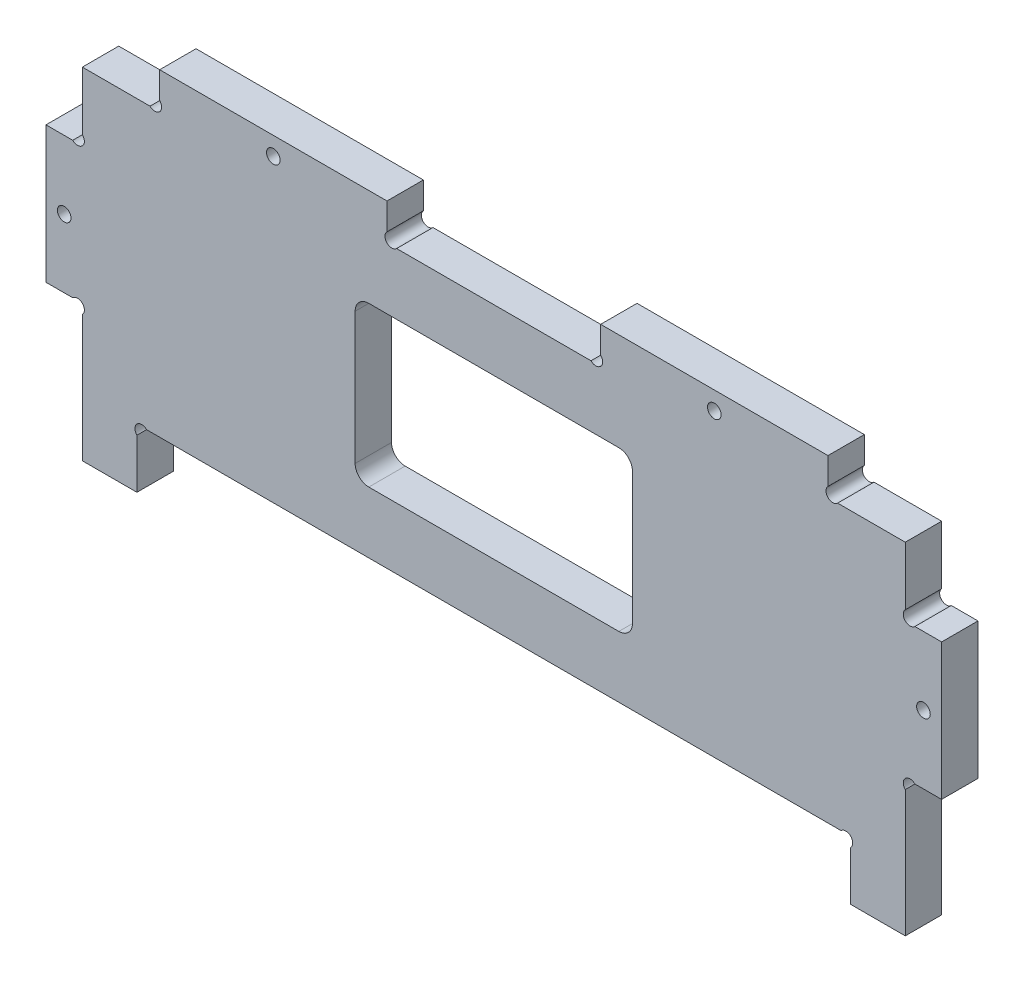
ISO-10303-21;
HEADER;
FILE_DESCRIPTION(('STEP AP214'),'2;1');
FILE_NAME('part.step','',(''),(''),'','','');
FILE_SCHEMA(('AUTOMOTIVE_DESIGN { 1 0 10303 214 1 1 1 1 }'));
ENDSEC;
DATA;
#1=APPLICATION_CONTEXT('core data for automotive mechanical design processes');
#2=APPLICATION_PROTOCOL_DEFINITION('international standard','automotive_design',2000,#1);
#3=PRODUCT_CONTEXT('',#1,'mechanical');
#4=PRODUCT('Part','Part','',(#3));
#5=PRODUCT_RELATED_PRODUCT_CATEGORY('part','',(#4));
#6=PRODUCT_DEFINITION_FORMATION('','',#4);
#7=PRODUCT_DEFINITION_CONTEXT('part definition',#1,'design');
#8=PRODUCT_DEFINITION('design','',#6,#7);
#9=PRODUCT_DEFINITION_SHAPE('','',#8);
#10=(LENGTH_UNIT() NAMED_UNIT(*) SI_UNIT(.MILLI.,.METRE.));
#11=(NAMED_UNIT(*) PLANE_ANGLE_UNIT() SI_UNIT($,.RADIAN.));
#12=(NAMED_UNIT(*) SI_UNIT($,.STERADIAN.) SOLID_ANGLE_UNIT());
#13=UNCERTAINTY_MEASURE_WITH_UNIT(LENGTH_MEASURE(1.E-05),#10,'distance_accuracy_value','');
#14=(GEOMETRIC_REPRESENTATION_CONTEXT(3) GLOBAL_UNCERTAINTY_ASSIGNED_CONTEXT((#13)) GLOBAL_UNIT_ASSIGNED_CONTEXT((#10,
#11,#12)) REPRESENTATION_CONTEXT('',''));
#15=CARTESIAN_POINT('',(0.,0.,0.));
#16=DIRECTION('',(0.,0.,1.));
#17=DIRECTION('',(1.,0.,0.));
#18=AXIS2_PLACEMENT_3D('',#15,#16,#17);
#19=CARTESIAN_POINT('',(146.896258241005,11.5239491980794,8.));
#20=DIRECTION('',(0.,0.,1.));
#21=DIRECTION('',(1.,0.,0.));
#22=AXIS2_PLACEMENT_3D('',#19,#20,#21);
#23=PLANE('',#22);
#24=CARTESIAN_POINT('',(149.835598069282,-4.53671096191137,8.));
#25=DIRECTION('',(0.,0.,1.));
#26=DIRECTION('',(1.,0.,0.));
#27=AXIS2_PLACEMENT_3D('',#24,#25,#26);
#28=CIRCLE('',#27,1.5);
#29=CARTESIAN_POINT('',(151.335598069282,-4.53671096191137,8.));
#30=VERTEX_POINT('',#29);
#31=EDGE_CURVE('E384',#30,#30,#28,.T.);
#32=ORIENTED_EDGE('',*,*,#31,.F.);
#33=EDGE_LOOP('',(#32));
#34=FACE_BOUND('',#33,.T.);
#35=CARTESIAN_POINT('',(6.83559810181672,29.4632890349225,8.));
#36=DIRECTION('',(0.,0.,1.));
#37=DIRECTION('',(-1.,0.,0.));
#38=AXIS2_PLACEMENT_3D('',#35,#36,#37);
#39=CIRCLE('',#38,1.5);
#40=CARTESIAN_POINT('',(5.33559810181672,29.4632890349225,8.));
#41=VERTEX_POINT('',#40);
#42=EDGE_CURVE('E407',#41,#41,#39,.T.);
#43=ORIENTED_EDGE('',*,*,#42,.F.);
#44=EDGE_LOOP('',(#43));
#45=FACE_BOUND('',#44,.T.);
#46=CARTESIAN_POINT('',(146.896258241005,11.5239491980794,8.));
#47=DIRECTION('',(0.,0.,-1.));
#48=DIRECTION('',(1.,0.,0.));
#49=AXIS2_PLACEMENT_3D('',#46,#47,#48);
#50=CIRCLE('',#49,1.49999999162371);
#51=CARTESIAN_POINT('',(147.956918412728,10.4632890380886,8.));
#52=VERTEX_POINT('',#51);
#53=CARTESIAN_POINT('',(145.835598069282,12.5846093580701,8.));
#54=VERTEX_POINT('',#53);
#55=EDGE_CURVE('E312',#52,#54,#50,.T.);
#56=ORIENTED_EDGE('',*,*,#55,.T.);
#57=DIRECTION('',(0.,1.,0.));
#58=VECTOR('',#57,1.);
#59=CARTESIAN_POINT('',(145.835598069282,12.5846093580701,8.));
#60=LINE('',#59,#58);
#61=CARTESIAN_POINT('',(145.835598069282,25.4632890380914,8.));
#62=VERTEX_POINT('',#61);
#63=EDGE_CURVE('E301',#54,#62,#60,.T.);
#64=ORIENTED_EDGE('',*,*,#63,.T.);
#65=DIRECTION('',(-1.,0.,0.));
#66=VECTOR('',#65,1.);
#67=CARTESIAN_POINT('',(130.956918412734,25.4632890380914,8.));
#68=LINE('',#67,#66);
#69=CARTESIAN_POINT('',(130.956918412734,25.4632890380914,8.));
#70=VERTEX_POINT('',#69);
#71=EDGE_CURVE('E311',#62,#70,#68,.T.);
#72=ORIENTED_EDGE('',*,*,#71,.T.);
#73=CARTESIAN_POINT('',(129.896258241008,26.5239492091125,8.));
#74=DIRECTION('',(0.,0.,-1.));
#75=DIRECTION('',(1.,0.,0.));
#76=AXIS2_PLACEMENT_3D('',#73,#74,#75);
#77=CIRCLE('',#76,1.49999999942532);
#78=CARTESIAN_POINT('',(128.835598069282,27.5846093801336,8.));
#79=VERTEX_POINT('',#78);
#80=EDGE_CURVE('E419',#70,#79,#77,.T.);
#81=ORIENTED_EDGE('',*,*,#80,.T.);
#82=DIRECTION('',(0.,1.,0.));
#83=VECTOR('',#82,1.);
#84=CARTESIAN_POINT('',(128.835598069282,33.4632890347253,8.));
#85=LINE('',#84,#83);
#86=CARTESIAN_POINT('',(128.835598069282,33.4632890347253,8.));
#87=VERTEX_POINT('',#86);
#88=EDGE_CURVE('E421',#79,#87,#85,.T.);
#89=ORIENTED_EDGE('',*,*,#88,.T.);
#90=DIRECTION('',(-1.,0.,0.));
#91=VECTOR('',#90,1.);
#92=CARTESIAN_POINT('',(78.8355980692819,33.4632890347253,8.));
#93=LINE('',#92,#91);
#94=CARTESIAN_POINT('',(78.8355980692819,33.4632890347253,8.));
#95=VERTEX_POINT('',#94);
#96=EDGE_CURVE('E423',#87,#95,#93,.T.);
#97=ORIENTED_EDGE('',*,*,#96,.T.);
#98=DIRECTION('',(0.,-1.,0.));
#99=VECTOR('',#98,1.);
#100=CARTESIAN_POINT('',(78.8355980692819,27.5846093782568,8.));
#101=LINE('',#100,#99);
#102=CARTESIAN_POINT('',(78.8355980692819,27.5846093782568,8.));
#103=VERTEX_POINT('',#102);
#104=EDGE_CURVE('E425',#95,#103,#101,.T.);
#105=ORIENTED_EDGE('',*,*,#104,.T.);
#106=CARTESIAN_POINT('',(77.7749378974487,26.5239492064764,8.));
#107=DIRECTION('',(0.,0.,-1.));
#108=DIRECTION('',(1.,0.,0.));
#109=AXIS2_PLACEMENT_3D('',#106,#107,#108);
#110=CIRCLE('',#109,1.50000000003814);
#111=CARTESIAN_POINT('',(76.7142777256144,25.4632890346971,8.));
#112=VERTEX_POINT('',#111);
#113=EDGE_CURVE('E427',#103,#112,#110,.T.);
#114=ORIENTED_EDGE('',*,*,#113,.T.);
#115=DIRECTION('',(-1.,0.,0.));
#116=VECTOR('',#115,1.);
#117=CARTESIAN_POINT('',(76.7142777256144,25.4632890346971,8.));
#118=LINE('',#117,#116);
#119=CARTESIAN_POINT('',(33.9569184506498,25.4632890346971,8.));
#120=VERTEX_POINT('',#119);
#121=EDGE_CURVE('E429',#112,#120,#118,.T.);
#122=ORIENTED_EDGE('',*,*,#121,.T.);
#123=CARTESIAN_POINT('',(32.8962582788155,26.5239492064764,8.));
#124=DIRECTION('',(0.,0.,-1.));
#125=DIRECTION('',(-1.,0.,0.));
#126=AXIS2_PLACEMENT_3D('',#123,#124,#125);
#127=CIRCLE('',#126,1.50000000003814);
#128=CARTESIAN_POINT('',(31.8355981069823,27.5846093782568,8.));
#129=VERTEX_POINT('',#128);
#130=EDGE_CURVE('E431',#120,#129,#127,.T.);
#131=ORIENTED_EDGE('',*,*,#130,.T.);
#132=DIRECTION('',(0.,1.,0.));
#133=VECTOR('',#132,1.);
#134=CARTESIAN_POINT('',(31.8355981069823,27.5846093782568,8.));
#135=LINE('',#134,#133);
#136=CARTESIAN_POINT('',(31.8355981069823,33.4632890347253,8.));
#137=VERTEX_POINT('',#136);
#138=EDGE_CURVE('E433',#129,#137,#135,.T.);
#139=ORIENTED_EDGE('',*,*,#138,.T.);
#140=DIRECTION('',(-1.,0.,0.));
#141=VECTOR('',#140,1.);
#142=CARTESIAN_POINT('',(31.8355981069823,33.4632890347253,8.));
#143=LINE('',#142,#141);
#144=CARTESIAN_POINT('',(-18.1644018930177,33.4632890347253,8.));
#145=VERTEX_POINT('',#144);
#146=EDGE_CURVE('E435',#137,#145,#143,.T.);
#147=ORIENTED_EDGE('',*,*,#146,.T.);
#148=DIRECTION('',(0.,-1.,0.));
#149=VECTOR('',#148,1.);
#150=CARTESIAN_POINT('',(-18.1644018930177,33.4632890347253,8.));
#151=LINE('',#150,#149);
#152=CARTESIAN_POINT('',(-18.1644018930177,27.5846093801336,8.));
#153=VERTEX_POINT('',#152);
#154=EDGE_CURVE('E437',#145,#153,#151,.T.);
#155=ORIENTED_EDGE('',*,*,#154,.T.);
#156=CARTESIAN_POINT('',(-19.2250620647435,26.5239492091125,8.));
#157=DIRECTION('',(0.,0.,-1.));
#158=DIRECTION('',(-1.,0.,0.));
#159=AXIS2_PLACEMENT_3D('',#156,#157,#158);
#160=CIRCLE('',#159,1.49999999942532);
#161=CARTESIAN_POINT('',(-20.2857222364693,25.4632890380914,8.));
#162=VERTEX_POINT('',#161);
#163=EDGE_CURVE('E439',#153,#162,#160,.T.);
#164=ORIENTED_EDGE('',*,*,#163,.T.);
#165=DIRECTION('',(-1.,0.,0.));
#166=VECTOR('',#165,1.);
#167=CARTESIAN_POINT('',(-20.2857222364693,25.4632890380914,8.));
#168=LINE('',#167,#166);
#169=CARTESIAN_POINT('',(-35.1644018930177,25.4632890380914,8.));
#170=VERTEX_POINT('',#169);
#171=EDGE_CURVE('E441',#162,#170,#168,.T.);
#172=ORIENTED_EDGE('',*,*,#171,.T.);
#173=DIRECTION('',(0.,-1.,0.));
#174=VECTOR('',#173,1.);
#175=CARTESIAN_POINT('',(-35.1644018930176,13.0239491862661,8.));
#176=LINE('',#175,#174);
#177=CARTESIAN_POINT('',(-35.1644018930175,12.5846093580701,8.));
#178=VERTEX_POINT('',#177);
#179=EDGE_CURVE('E443',#170,#178,#176,.T.);
#180=ORIENTED_EDGE('',*,*,#179,.T.);
#181=CARTESIAN_POINT('',(-36.2250620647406,11.5239491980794,8.));
#182=DIRECTION('',(0.,0.,-1.));
#183=DIRECTION('',(-1.,0.,0.));
#184=AXIS2_PLACEMENT_3D('',#181,#182,#183);
#185=CIRCLE('',#184,1.49999999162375);
#186=CARTESIAN_POINT('',(-37.2857222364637,10.4632890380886,8.));
#187=VERTEX_POINT('',#186);
#188=EDGE_CURVE('E445',#178,#187,#185,.T.);
#189=ORIENTED_EDGE('',*,*,#188,.T.);
#190=DIRECTION('',(-1.,0.,0.));
#191=VECTOR('',#190,1.);
#192=CARTESIAN_POINT('',(-43.1644018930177,10.4632890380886,8.));
#193=LINE('',#192,#191);
#194=CARTESIAN_POINT('',(-43.1644018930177,10.4632890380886,8.));
#195=VERTEX_POINT('',#194);
#196=EDGE_CURVE('E447',#187,#195,#193,.T.);
#197=ORIENTED_EDGE('',*,*,#196,.T.);
#198=DIRECTION('',(0.,-1.,0.));
#199=VECTOR('',#198,1.);
#200=CARTESIAN_POINT('',(-43.1644018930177,-19.5367109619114,8.));
#201=LINE('',#200,#199);
#202=CARTESIAN_POINT('',(-43.1644018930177,-19.5367109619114,8.));
#203=VERTEX_POINT('',#202);
#204=EDGE_CURVE('E449',#195,#203,#201,.T.);
#205=ORIENTED_EDGE('',*,*,#204,.T.);
#206=DIRECTION('',(1.,0.,0.));
#207=VECTOR('',#206,1.);
#208=CARTESIAN_POINT('',(-37.2857222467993,-19.5367109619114,8.));
#209=LINE('',#208,#207);
#210=CARTESIAN_POINT('',(-37.2857222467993,-19.5367109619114,8.));
#211=VERTEX_POINT('',#210);
#212=EDGE_CURVE('E451',#203,#211,#209,.T.);
#213=ORIENTED_EDGE('',*,*,#212,.T.);
#214=CARTESIAN_POINT('',(-36.2250620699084,-20.5973711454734,8.));
#215=DIRECTION('',(0.,0.,-1.));
#216=DIRECTION('',(-1.,0.,0.));
#217=AXIS2_PLACEMENT_3D('',#214,#215,#216);
#218=CIRCLE('',#217,1.50000001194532);
#219=CARTESIAN_POINT('',(-35.1644018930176,-21.6580313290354,8.));
#220=VERTEX_POINT('',#219);
#221=EDGE_CURVE('E453',#211,#220,#218,.T.);
#222=ORIENTED_EDGE('',*,*,#221,.T.);
#223=DIRECTION('',(0.,-1.,0.));
#224=VECTOR('',#223,1.);
#225=CARTESIAN_POINT('',(-35.1644018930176,-22.0973711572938,8.));
#226=LINE('',#225,#224);
#227=CARTESIAN_POINT('',(-35.1644018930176,-49.5367109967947,8.));
#228=VERTEX_POINT('',#227);
#229=EDGE_CURVE('E455',#220,#228,#226,.T.);
#230=ORIENTED_EDGE('',*,*,#229,.T.);
#231=DIRECTION('',(1.,0.,0.));
#232=VECTOR('',#231,1.);
#233=CARTESIAN_POINT('',(-35.1644018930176,-49.5367109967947,8.));
#234=LINE('',#233,#232);
#235=CARTESIAN_POINT('',(-23.1644018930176,-49.5367109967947,8.));
#236=VERTEX_POINT('',#235);
#237=EDGE_CURVE('E457',#228,#236,#234,.T.);
#238=ORIENTED_EDGE('',*,*,#237,.T.);
#239=DIRECTION('',(0.,1.,0.));
#240=VECTOR('',#239,1.);
#241=CARTESIAN_POINT('',(-23.1644018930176,-49.5367109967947,8.));
#242=LINE('',#241,#240);
#243=CARTESIAN_POINT('',(-23.1644018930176,-38.6580313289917,8.));
#244=VERTEX_POINT('',#243);
#245=EDGE_CURVE('E459',#236,#244,#242,.T.);
#246=ORIENTED_EDGE('',*,*,#245,.T.);
#247=CARTESIAN_POINT('',(-22.1037417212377,-37.5973711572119,8.));
#248=DIRECTION('',(0.,0.,-1.));
#249=DIRECTION('',(1.,0.,0.));
#250=AXIS2_PLACEMENT_3D('',#247,#248,#249);
#251=CIRCLE('',#250,1.5);
#252=CARTESIAN_POINT('',(-21.0430815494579,-36.5367109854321,8.));
#253=VERTEX_POINT('',#252);
#254=EDGE_CURVE('E461',#244,#253,#251,.T.);
#255=ORIENTED_EDGE('',*,*,#254,.T.);
#256=DIRECTION('',(1.,0.,0.));
#257=VECTOR('',#256,1.);
#258=CARTESIAN_POINT('',(-21.0430815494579,-36.5367109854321,8.));
#259=LINE('',#258,#257);
#260=CARTESIAN_POINT('',(131.714277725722,-36.536710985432,8.));
#261=VERTEX_POINT('',#260);
#262=EDGE_CURVE('E463',#253,#261,#259,.T.);
#263=ORIENTED_EDGE('',*,*,#262,.T.);
#264=CARTESIAN_POINT('',(132.774937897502,-37.5973711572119,8.));
#265=DIRECTION('',(0.,0.,-1.));
#266=DIRECTION('',(1.,0.,0.));
#267=AXIS2_PLACEMENT_3D('',#264,#265,#266);
#268=CIRCLE('',#267,1.49999999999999);
#269=CARTESIAN_POINT('',(133.835598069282,-38.6580313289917,8.));
#270=VERTEX_POINT('',#269);
#271=EDGE_CURVE('E465',#261,#270,#268,.T.);
#272=ORIENTED_EDGE('',*,*,#271,.T.);
#273=DIRECTION('',(0.,-1.,0.));
#274=VECTOR('',#273,1.);
#275=CARTESIAN_POINT('',(133.835598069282,-49.5367109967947,8.));
#276=LINE('',#275,#274);
#277=CARTESIAN_POINT('',(133.835598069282,-49.5367109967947,8.));
#278=VERTEX_POINT('',#277);
#279=EDGE_CURVE('E467',#270,#278,#276,.T.);
#280=ORIENTED_EDGE('',*,*,#279,.T.);
#281=DIRECTION('',(1.,0.,0.));
#282=VECTOR('',#281,1.);
#283=CARTESIAN_POINT('',(145.835598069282,-49.5367109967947,8.));
#284=LINE('',#283,#282);
#285=CARTESIAN_POINT('',(145.835598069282,-49.5367109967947,8.));
#286=VERTEX_POINT('',#285);
#287=EDGE_CURVE('E469',#278,#286,#284,.T.);
#288=ORIENTED_EDGE('',*,*,#287,.T.);
#289=DIRECTION('',(0.,1.,0.));
#290=VECTOR('',#289,1.);
#291=CARTESIAN_POINT('',(145.835598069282,-36.5367109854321,8.));
#292=LINE('',#291,#290);
#293=CARTESIAN_POINT('',(145.835598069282,-21.6580313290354,8.));
#294=VERTEX_POINT('',#293);
#295=EDGE_CURVE('E471',#286,#294,#292,.T.);
#296=ORIENTED_EDGE('',*,*,#295,.T.);
#297=CARTESIAN_POINT('',(146.896258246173,-20.5973711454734,8.));
#298=DIRECTION('',(0.,0.,-1.));
#299=DIRECTION('',(1.,0.,0.));
#300=AXIS2_PLACEMENT_3D('',#297,#298,#299);
#301=CIRCLE('',#300,1.50000001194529);
#302=CARTESIAN_POINT('',(147.956918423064,-19.5367109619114,8.));
#303=VERTEX_POINT('',#302);
#304=EDGE_CURVE('E473',#294,#303,#301,.T.);
#305=ORIENTED_EDGE('',*,*,#304,.T.);
#306=DIRECTION('',(1.,0.,0.));
#307=VECTOR('',#306,1.);
#308=CARTESIAN_POINT('',(147.956918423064,-19.5367109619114,8.));
#309=LINE('',#308,#307);
#310=CARTESIAN_POINT('',(153.835598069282,-19.5367109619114,8.));
#311=VERTEX_POINT('',#310);
#312=EDGE_CURVE('E475',#303,#311,#309,.T.);
#313=ORIENTED_EDGE('',*,*,#312,.T.);
#314=DIRECTION('',(0.,1.,0.));
#315=VECTOR('',#314,1.);
#316=CARTESIAN_POINT('',(153.835598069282,-19.5367109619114,8.));
#317=LINE('',#316,#315);
#318=CARTESIAN_POINT('',(153.835598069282,10.4632890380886,8.));
#319=VERTEX_POINT('',#318);
#320=EDGE_CURVE('E477',#311,#319,#317,.T.);
#321=ORIENTED_EDGE('',*,*,#320,.T.);
#322=DIRECTION('',(-1.,0.,0.));
#323=VECTOR('',#322,1.);
#324=CARTESIAN_POINT('',(153.835598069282,10.4632890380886,8.));
#325=LINE('',#324,#323);
#326=EDGE_CURVE('E317',#319,#52,#325,.T.);
#327=ORIENTED_EDGE('',*,*,#326,.T.);
#328=EDGE_LOOP('',(#56,#64,#72,#81,#89,#97,#105,#114,#122,#131,#139,#147,#155,#164,#172,#180,
#189,#197,#205,#213,#222,#230,#238,#246,#255,#263,#272,#280,#288,#296,#305,#313,#321,#327));
#329=FACE_BOUND('',#328,.T.);
#330=CARTESIAN_POINT('',(-39.1644018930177,-4.5367109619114,8.));
#331=DIRECTION('',(0.,0.,1.));
#332=DIRECTION('',(-1.,0.,0.));
#333=AXIS2_PLACEMENT_3D('',#330,#331,#332);
#334=CIRCLE('',#333,1.5);
#335=CARTESIAN_POINT('',(-40.6644018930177,-4.5367109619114,8.));
#336=VERTEX_POINT('',#335);
#337=EDGE_CURVE('E413',#336,#336,#334,.T.);
#338=ORIENTED_EDGE('',*,*,#337,.F.);
#339=EDGE_LOOP('',(#338));
#340=FACE_BOUND('',#339,.T.);
#341=CARTESIAN_POINT('',(103.835598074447,29.4632890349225,8.));
#342=DIRECTION('',(0.,0.,1.));
#343=DIRECTION('',(1.,0.,0.));
#344=AXIS2_PLACEMENT_3D('',#341,#342,#343);
#345=CIRCLE('',#344,1.5);
#346=CARTESIAN_POINT('',(105.335598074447,29.4632890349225,8.));
#347=VERTEX_POINT('',#346);
#348=EDGE_CURVE('E401',#347,#347,#345,.T.);
#349=ORIENTED_EDGE('',*,*,#348,.F.);
#350=EDGE_LOOP('',(#349));
#351=FACE_BOUND('',#350,.T.);
#352=DIRECTION('',(1.,0.,0.));
#353=VECTOR('',#352,1.);
#354=CARTESIAN_POINT('',(24.8355981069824,-23.0367109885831,8.));
#355=LINE('',#354,#353);
#356=CARTESIAN_POINT('',(27.8355981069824,-23.0367109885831,8.));
#357=VERTEX_POINT('',#356);
#358=CARTESIAN_POINT('',(82.8355981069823,-23.0367109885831,8.));
#359=VERTEX_POINT('',#358);
#360=EDGE_CURVE('E387',#357,#359,#355,.T.);
#361=ORIENTED_EDGE('',*,*,#360,.F.);
#362=CARTESIAN_POINT('',(27.8355981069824,-20.0367109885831,8.));
#363=DIRECTION('',(0.,0.,1.));
#364=DIRECTION('',(1.,0.,0.));
#365=AXIS2_PLACEMENT_3D('',#362,#363,#364);
#366=CIRCLE('',#365,3.);
#367=CARTESIAN_POINT('',(24.8355981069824,-20.0367109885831,8.));
#368=VERTEX_POINT('',#367);
#369=EDGE_CURVE('E352',#357,#368,#366,.F.);
#370=ORIENTED_EDGE('',*,*,#369,.T.);
#371=DIRECTION('',(0.,-1.,0.));
#372=VECTOR('',#371,1.);
#373=CARTESIAN_POINT('',(24.8355981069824,11.9632890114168,8.));
#374=LINE('',#373,#372);
#375=CARTESIAN_POINT('',(24.8355981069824,8.96328901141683,8.));
#376=VERTEX_POINT('',#375);
#377=EDGE_CURVE('E397',#376,#368,#374,.T.);
#378=ORIENTED_EDGE('',*,*,#377,.F.);
#379=CARTESIAN_POINT('',(27.8355981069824,8.96328901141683,8.));
#380=DIRECTION('',(0.,0.,1.));
#381=DIRECTION('',(1.,0.,0.));
#382=AXIS2_PLACEMENT_3D('',#379,#380,#381);
#383=CIRCLE('',#382,3.);
#384=CARTESIAN_POINT('',(27.8355981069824,11.9632890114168,8.));
#385=VERTEX_POINT('',#384);
#386=EDGE_CURVE('E11',#376,#385,#383,.F.);
#387=ORIENTED_EDGE('',*,*,#386,.T.);
#388=DIRECTION('',(-1.,0.,0.));
#389=VECTOR('',#388,1.);
#390=CARTESIAN_POINT('',(24.8355981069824,11.9632890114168,8.));
#391=LINE('',#390,#389);
#392=CARTESIAN_POINT('',(82.8355981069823,11.9632890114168,8.));
#393=VERTEX_POINT('',#392);
#394=EDGE_CURVE('E378',#393,#385,#391,.T.);
#395=ORIENTED_EDGE('',*,*,#394,.F.);
#396=CARTESIAN_POINT('',(82.8355981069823,8.96328901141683,8.));
#397=DIRECTION('',(0.,0.,1.));
#398=DIRECTION('',(1.,0.,0.));
#399=AXIS2_PLACEMENT_3D('',#396,#397,#398);
#400=CIRCLE('',#399,3.);
#401=CARTESIAN_POINT('',(85.8355981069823,8.96328901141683,8.));
#402=VERTEX_POINT('',#401);
#403=EDGE_CURVE('E360',#393,#402,#400,.F.);
#404=ORIENTED_EDGE('',*,*,#403,.T.);
#405=DIRECTION('',(0.,1.,0.));
#406=VECTOR('',#405,1.);
#407=CARTESIAN_POINT('',(85.8355981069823,11.9632890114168,8.));
#408=LINE('',#407,#406);
#409=CARTESIAN_POINT('',(85.8355981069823,-20.0367109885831,8.));
#410=VERTEX_POINT('',#409);
#411=EDGE_CURVE('E381',#410,#402,#408,.T.);
#412=ORIENTED_EDGE('',*,*,#411,.F.);
#413=CARTESIAN_POINT('',(82.8355981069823,-20.0367109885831,8.));
#414=DIRECTION('',(0.,0.,1.));
#415=DIRECTION('',(1.,0.,0.));
#416=AXIS2_PLACEMENT_3D('',#413,#414,#415);
#417=CIRCLE('',#416,3.);
#418=EDGE_CURVE('E356',#410,#359,#417,.F.);
#419=ORIENTED_EDGE('',*,*,#418,.T.);
#420=EDGE_LOOP('',(#361,#370,#378,#387,#395,#404,#412,#419));
#421=FACE_BOUND('',#420,.T.);
#422=ADVANCED_FACE('F32',(#34,#45,#329,#340,#351,#421),#23,.T.);
#423=CARTESIAN_POINT('',(146.896258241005,11.5239491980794,0.));
#424=DIRECTION('',(0.,0.,1.));
#425=DIRECTION('',(1.,0.,0.));
#426=AXIS2_PLACEMENT_3D('',#423,#424,#425);
#427=PLANE('',#426);
#428=CARTESIAN_POINT('',(149.835598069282,-4.53671096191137,0.));
#429=DIRECTION('',(0.,0.,1.));
#430=DIRECTION('',(1.,0.,0.));
#431=AXIS2_PLACEMENT_3D('',#428,#429,#430);
#432=CIRCLE('',#431,1.5);
#433=CARTESIAN_POINT('',(151.335598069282,-4.53671096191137,0.));
#434=VERTEX_POINT('',#433);
#435=EDGE_CURVE('E380',#434,#434,#432,.T.);
#436=ORIENTED_EDGE('',*,*,#435,.T.);
#437=EDGE_LOOP('',(#436));
#438=FACE_BOUND('',#437,.T.);
#439=CARTESIAN_POINT('',(6.83559810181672,29.4632890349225,0.));
#440=DIRECTION('',(0.,0.,1.));
#441=DIRECTION('',(-1.,0.,0.));
#442=AXIS2_PLACEMENT_3D('',#439,#440,#441);
#443=CIRCLE('',#442,1.5);
#444=CARTESIAN_POINT('',(5.33559810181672,29.4632890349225,0.));
#445=VERTEX_POINT('',#444);
#446=EDGE_CURVE('E404',#445,#445,#443,.T.);
#447=ORIENTED_EDGE('',*,*,#446,.T.);
#448=EDGE_LOOP('',(#447));
#449=FACE_BOUND('',#448,.T.);
#450=CARTESIAN_POINT('',(146.896258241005,11.5239491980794,0.));
#451=DIRECTION('',(0.,0.,-1.));
#452=DIRECTION('',(1.,0.,0.));
#453=AXIS2_PLACEMENT_3D('',#450,#451,#452);
#454=CIRCLE('',#453,1.49999999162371);
#455=CARTESIAN_POINT('',(147.956918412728,10.4632890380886,0.));
#456=VERTEX_POINT('',#455);
#457=CARTESIAN_POINT('',(145.835598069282,12.5846093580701,0.));
#458=VERTEX_POINT('',#457);
#459=EDGE_CURVE('E325',#456,#458,#454,.T.);
#460=ORIENTED_EDGE('',*,*,#459,.F.);
#461=DIRECTION('',(-1.,0.,0.));
#462=VECTOR('',#461,1.);
#463=CARTESIAN_POINT('',(153.835598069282,10.4632890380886,0.));
#464=LINE('',#463,#462);
#465=CARTESIAN_POINT('',(153.835598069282,10.4632890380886,0.));
#466=VERTEX_POINT('',#465);
#467=EDGE_CURVE('E321',#466,#456,#464,.T.);
#468=ORIENTED_EDGE('',*,*,#467,.F.);
#469=DIRECTION('',(0.,1.,0.));
#470=VECTOR('',#469,1.);
#471=CARTESIAN_POINT('',(153.835598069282,-19.5367109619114,0.));
#472=LINE('',#471,#470);
#473=CARTESIAN_POINT('',(153.835598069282,-19.5367109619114,0.));
#474=VERTEX_POINT('',#473);
#475=EDGE_CURVE('E548',#474,#466,#472,.T.);
#476=ORIENTED_EDGE('',*,*,#475,.F.);
#477=DIRECTION('',(1.,0.,0.));
#478=VECTOR('',#477,1.);
#479=CARTESIAN_POINT('',(147.956918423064,-19.5367109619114,0.));
#480=LINE('',#479,#478);
#481=CARTESIAN_POINT('',(147.956918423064,-19.5367109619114,0.));
#482=VERTEX_POINT('',#481);
#483=EDGE_CURVE('E546',#482,#474,#480,.T.);
#484=ORIENTED_EDGE('',*,*,#483,.F.);
#485=CARTESIAN_POINT('',(146.896258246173,-20.5973711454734,0.));
#486=DIRECTION('',(0.,0.,-1.));
#487=DIRECTION('',(1.,0.,0.));
#488=AXIS2_PLACEMENT_3D('',#485,#486,#487);
#489=CIRCLE('',#488,1.50000001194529);
#490=CARTESIAN_POINT('',(145.835598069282,-21.6580313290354,0.));
#491=VERTEX_POINT('',#490);
#492=EDGE_CURVE('E544',#491,#482,#489,.T.);
#493=ORIENTED_EDGE('',*,*,#492,.F.);
#494=DIRECTION('',(0.,1.,0.));
#495=VECTOR('',#494,1.);
#496=CARTESIAN_POINT('',(145.835598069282,-22.0973711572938,0.));
#497=LINE('',#496,#495);
#498=CARTESIAN_POINT('',(145.835598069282,-49.5367109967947,0.));
#499=VERTEX_POINT('',#498);
#500=EDGE_CURVE('E542',#499,#491,#497,.T.);
#501=ORIENTED_EDGE('',*,*,#500,.F.);
#502=DIRECTION('',(1.,0.,0.));
#503=VECTOR('',#502,1.);
#504=CARTESIAN_POINT('',(145.835598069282,-49.5367109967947,0.));
#505=LINE('',#504,#503);
#506=CARTESIAN_POINT('',(133.835598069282,-49.5367109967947,0.));
#507=VERTEX_POINT('',#506);
#508=EDGE_CURVE('E539',#507,#499,#505,.T.);
#509=ORIENTED_EDGE('',*,*,#508,.F.);
#510=DIRECTION('',(0.,-1.,0.));
#511=VECTOR('',#510,1.);
#512=CARTESIAN_POINT('',(133.835598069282,-49.5367109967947,0.));
#513=LINE('',#512,#511);
#514=CARTESIAN_POINT('',(133.835598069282,-38.6580313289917,0.));
#515=VERTEX_POINT('',#514);
#516=EDGE_CURVE('E537',#515,#507,#513,.T.);
#517=ORIENTED_EDGE('',*,*,#516,.F.);
#518=CARTESIAN_POINT('',(132.774937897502,-37.5973711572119,0.));
#519=DIRECTION('',(0.,0.,-1.));
#520=DIRECTION('',(1.,0.,0.));
#521=AXIS2_PLACEMENT_3D('',#518,#519,#520);
#522=CIRCLE('',#521,1.49999999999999);
#523=CARTESIAN_POINT('',(131.714277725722,-36.536710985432,0.));
#524=VERTEX_POINT('',#523);
#525=EDGE_CURVE('E535',#524,#515,#522,.T.);
#526=ORIENTED_EDGE('',*,*,#525,.F.);
#527=DIRECTION('',(1.,0.,0.));
#528=VECTOR('',#527,1.);
#529=CARTESIAN_POINT('',(24.7142777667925,-36.5367109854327,0.));
#530=LINE('',#529,#528);
#531=CARTESIAN_POINT('',(-21.0430815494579,-36.5367109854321,0.));
#532=VERTEX_POINT('',#531);
#533=EDGE_CURVE('E533',#532,#524,#530,.T.);
#534=ORIENTED_EDGE('',*,*,#533,.F.);
#535=CARTESIAN_POINT('',(-22.1037417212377,-37.5973711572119,0.));
#536=DIRECTION('',(0.,0.,-1.));
#537=DIRECTION('',(1.,0.,0.));
#538=AXIS2_PLACEMENT_3D('',#535,#536,#537);
#539=CIRCLE('',#538,1.5);
#540=CARTESIAN_POINT('',(-23.1644018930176,-38.6580313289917,0.));
#541=VERTEX_POINT('',#540);
#542=EDGE_CURVE('E530',#541,#532,#539,.T.);
#543=ORIENTED_EDGE('',*,*,#542,.F.);
#544=DIRECTION('',(0.,1.,0.));
#545=VECTOR('',#544,1.);
#546=CARTESIAN_POINT('',(-23.1644018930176,-49.5367109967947,0.));
#547=LINE('',#546,#545);
#548=CARTESIAN_POINT('',(-23.1644018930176,-49.5367109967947,0.));
#549=VERTEX_POINT('',#548);
#550=EDGE_CURVE('E528',#549,#541,#547,.T.);
#551=ORIENTED_EDGE('',*,*,#550,.F.);
#552=DIRECTION('',(1.,0.,0.));
#553=VECTOR('',#552,1.);
#554=CARTESIAN_POINT('',(-35.1644018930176,-49.5367109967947,0.));
#555=LINE('',#554,#553);
#556=CARTESIAN_POINT('',(-35.1644018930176,-49.5367109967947,0.));
#557=VERTEX_POINT('',#556);
#558=EDGE_CURVE('E526',#557,#549,#555,.T.);
#559=ORIENTED_EDGE('',*,*,#558,.F.);
#560=DIRECTION('',(0.,-1.,0.));
#561=VECTOR('',#560,1.);
#562=CARTESIAN_POINT('',(-35.1644018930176,-36.5367109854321,0.));
#563=LINE('',#562,#561);
#564=CARTESIAN_POINT('',(-35.1644018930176,-21.6580313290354,0.));
#565=VERTEX_POINT('',#564);
#566=EDGE_CURVE('E524',#565,#557,#563,.T.);
#567=ORIENTED_EDGE('',*,*,#566,.F.);
#568=CARTESIAN_POINT('',(-36.2250620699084,-20.5973711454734,0.));
#569=DIRECTION('',(0.,0.,-1.));
#570=DIRECTION('',(-1.,0.,0.));
#571=AXIS2_PLACEMENT_3D('',#568,#569,#570);
#572=CIRCLE('',#571,1.50000001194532);
#573=CARTESIAN_POINT('',(-37.2857222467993,-19.5367109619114,0.));
#574=VERTEX_POINT('',#573);
#575=EDGE_CURVE('E521',#574,#565,#572,.T.);
#576=ORIENTED_EDGE('',*,*,#575,.F.);
#577=DIRECTION('',(1.,0.,0.));
#578=VECTOR('',#577,1.);
#579=CARTESIAN_POINT('',(-37.2857222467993,-19.5367109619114,0.));
#580=LINE('',#579,#578);
#581=CARTESIAN_POINT('',(-43.1644018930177,-19.5367109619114,0.));
#582=VERTEX_POINT('',#581);
#583=EDGE_CURVE('E519',#582,#574,#580,.T.);
#584=ORIENTED_EDGE('',*,*,#583,.F.);
#585=DIRECTION('',(0.,-1.,0.));
#586=VECTOR('',#585,1.);
#587=CARTESIAN_POINT('',(-43.1644018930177,-19.5367109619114,0.));
#588=LINE('',#587,#586);
#589=CARTESIAN_POINT('',(-43.1644018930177,10.4632890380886,0.));
#590=VERTEX_POINT('',#589);
#591=EDGE_CURVE('E517',#590,#582,#588,.T.);
#592=ORIENTED_EDGE('',*,*,#591,.F.);
#593=DIRECTION('',(-1.,0.,0.));
#594=VECTOR('',#593,1.);
#595=CARTESIAN_POINT('',(-43.1644018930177,10.4632890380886,0.));
#596=LINE('',#595,#594);
#597=CARTESIAN_POINT('',(-37.2857222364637,10.4632890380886,0.));
#598=VERTEX_POINT('',#597);
#599=EDGE_CURVE('E515',#598,#590,#596,.T.);
#600=ORIENTED_EDGE('',*,*,#599,.F.);
#601=CARTESIAN_POINT('',(-36.2250620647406,11.5239491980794,0.));
#602=DIRECTION('',(0.,0.,-1.));
#603=DIRECTION('',(-1.,0.,0.));
#604=AXIS2_PLACEMENT_3D('',#601,#602,#603);
#605=CIRCLE('',#604,1.49999999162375);
#606=CARTESIAN_POINT('',(-35.1644018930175,12.5846093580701,0.));
#607=VERTEX_POINT('',#606);
#608=EDGE_CURVE('E513',#607,#598,#605,.T.);
#609=ORIENTED_EDGE('',*,*,#608,.F.);
#610=DIRECTION('',(0.,-1.,0.));
#611=VECTOR('',#610,1.);
#612=CARTESIAN_POINT('',(-35.1644018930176,12.5846093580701,0.));
#613=LINE('',#612,#611);
#614=CARTESIAN_POINT('',(-35.1644018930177,25.4632890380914,0.));
#615=VERTEX_POINT('',#614);
#616=EDGE_CURVE('E511',#615,#607,#613,.T.);
#617=ORIENTED_EDGE('',*,*,#616,.F.);
#618=DIRECTION('',(-1.,0.,0.));
#619=VECTOR('',#618,1.);
#620=CARTESIAN_POINT('',(-20.2857222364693,25.4632890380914,0.));
#621=LINE('',#620,#619);
#622=CARTESIAN_POINT('',(-20.2857222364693,25.4632890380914,0.));
#623=VERTEX_POINT('',#622);
#624=EDGE_CURVE('E508',#623,#615,#621,.T.);
#625=ORIENTED_EDGE('',*,*,#624,.F.);
#626=CARTESIAN_POINT('',(-19.2250620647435,26.5239492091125,0.));
#627=DIRECTION('',(0.,0.,-1.));
#628=DIRECTION('',(-1.,0.,0.));
#629=AXIS2_PLACEMENT_3D('',#626,#627,#628);
#630=CIRCLE('',#629,1.49999999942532);
#631=CARTESIAN_POINT('',(-18.1644018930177,27.5846093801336,0.));
#632=VERTEX_POINT('',#631);
#633=EDGE_CURVE('E506',#632,#623,#630,.T.);
#634=ORIENTED_EDGE('',*,*,#633,.F.);
#635=DIRECTION('',(0.,-1.,0.));
#636=VECTOR('',#635,1.);
#637=CARTESIAN_POINT('',(-18.1644018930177,33.4632890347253,0.));
#638=LINE('',#637,#636);
#639=CARTESIAN_POINT('',(-18.1644018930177,33.4632890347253,0.));
#640=VERTEX_POINT('',#639);
#641=EDGE_CURVE('E504',#640,#632,#638,.T.);
#642=ORIENTED_EDGE('',*,*,#641,.F.);
#643=DIRECTION('',(-1.,0.,0.));
#644=VECTOR('',#643,1.);
#645=CARTESIAN_POINT('',(31.8355981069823,33.4632890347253,0.));
#646=LINE('',#645,#644);
#647=CARTESIAN_POINT('',(31.8355981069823,33.4632890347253,0.));
#648=VERTEX_POINT('',#647);
#649=EDGE_CURVE('E502',#648,#640,#646,.T.);
#650=ORIENTED_EDGE('',*,*,#649,.F.);
#651=DIRECTION('',(0.,1.,0.));
#652=VECTOR('',#651,1.);
#653=CARTESIAN_POINT('',(31.8355981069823,27.5846093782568,0.));
#654=LINE('',#653,#652);
#655=CARTESIAN_POINT('',(31.8355981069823,27.5846093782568,0.));
#656=VERTEX_POINT('',#655);
#657=EDGE_CURVE('E500',#656,#648,#654,.T.);
#658=ORIENTED_EDGE('',*,*,#657,.F.);
#659=CARTESIAN_POINT('',(32.8962582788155,26.5239492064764,0.));
#660=DIRECTION('',(0.,0.,-1.));
#661=DIRECTION('',(-1.,0.,0.));
#662=AXIS2_PLACEMENT_3D('',#659,#660,#661);
#663=CIRCLE('',#662,1.50000000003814);
#664=CARTESIAN_POINT('',(33.9569184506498,25.4632890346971,0.));
#665=VERTEX_POINT('',#664);
#666=EDGE_CURVE('E498',#665,#656,#663,.T.);
#667=ORIENTED_EDGE('',*,*,#666,.F.);
#668=DIRECTION('',(-1.,0.,0.));
#669=VECTOR('',#668,1.);
#670=CARTESIAN_POINT('',(76.7142777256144,25.4632890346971,0.));
#671=LINE('',#670,#669);
#672=CARTESIAN_POINT('',(76.7142777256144,25.4632890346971,0.));
#673=VERTEX_POINT('',#672);
#674=EDGE_CURVE('E496',#673,#665,#671,.T.);
#675=ORIENTED_EDGE('',*,*,#674,.F.);
#676=CARTESIAN_POINT('',(77.7749378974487,26.5239492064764,0.));
#677=DIRECTION('',(0.,0.,-1.));
#678=DIRECTION('',(1.,0.,0.));
#679=AXIS2_PLACEMENT_3D('',#676,#677,#678);
#680=CIRCLE('',#679,1.50000000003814);
#681=CARTESIAN_POINT('',(78.8355980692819,27.5846093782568,0.));
#682=VERTEX_POINT('',#681);
#683=EDGE_CURVE('E494',#682,#673,#680,.T.);
#684=ORIENTED_EDGE('',*,*,#683,.F.);
#685=DIRECTION('',(0.,-1.,0.));
#686=VECTOR('',#685,1.);
#687=CARTESIAN_POINT('',(78.8355980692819,27.5846093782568,0.));
#688=LINE('',#687,#686);
#689=CARTESIAN_POINT('',(78.8355980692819,33.4632890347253,0.));
#690=VERTEX_POINT('',#689);
#691=EDGE_CURVE('E492',#690,#682,#688,.T.);
#692=ORIENTED_EDGE('',*,*,#691,.F.);
#693=DIRECTION('',(-1.,0.,0.));
#694=VECTOR('',#693,1.);
#695=CARTESIAN_POINT('',(78.8355980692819,33.4632890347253,0.));
#696=LINE('',#695,#694);
#697=CARTESIAN_POINT('',(128.835598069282,33.4632890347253,0.));
#698=VERTEX_POINT('',#697);
#699=EDGE_CURVE('E490',#698,#690,#696,.T.);
#700=ORIENTED_EDGE('',*,*,#699,.F.);
#701=DIRECTION('',(0.,1.,0.));
#702=VECTOR('',#701,1.);
#703=CARTESIAN_POINT('',(128.835598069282,33.4632890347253,0.));
#704=LINE('',#703,#702);
#705=CARTESIAN_POINT('',(128.835598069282,27.5846093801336,0.));
#706=VERTEX_POINT('',#705);
#707=EDGE_CURVE('E488',#706,#698,#704,.T.);
#708=ORIENTED_EDGE('',*,*,#707,.F.);
#709=CARTESIAN_POINT('',(129.896258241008,26.5239492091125,0.));
#710=DIRECTION('',(0.,0.,-1.));
#711=DIRECTION('',(1.,0.,0.));
#712=AXIS2_PLACEMENT_3D('',#709,#710,#711);
#713=CIRCLE('',#712,1.49999999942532);
#714=CARTESIAN_POINT('',(130.956918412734,25.4632890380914,0.));
#715=VERTEX_POINT('',#714);
#716=EDGE_CURVE('E486',#715,#706,#713,.T.);
#717=ORIENTED_EDGE('',*,*,#716,.F.);
#718=DIRECTION('',(-1.,0.,0.));
#719=VECTOR('',#718,1.);
#720=CARTESIAN_POINT('',(130.956918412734,25.4632890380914,0.));
#721=LINE('',#720,#719);
#722=CARTESIAN_POINT('',(145.835598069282,25.4632890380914,0.));
#723=VERTEX_POINT('',#722);
#724=EDGE_CURVE('E484',#723,#715,#721,.T.);
#725=ORIENTED_EDGE('',*,*,#724,.F.);
#726=DIRECTION('',(0.,1.,0.));
#727=VECTOR('',#726,1.);
#728=CARTESIAN_POINT('',(145.835598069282,13.0239491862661,0.));
#729=LINE('',#728,#727);
#730=EDGE_CURVE('E482',#458,#723,#729,.T.);
#731=ORIENTED_EDGE('',*,*,#730,.F.);
#732=EDGE_LOOP('',(#460,#468,#476,#484,#493,#501,#509,#517,#526,#534,#543,#551,#559,#567,#576,
#584,#592,#600,#609,#617,#625,#634,#642,#650,#658,#667,#675,#684,#692,#700,#708,#717,#725,#731));
#733=FACE_BOUND('',#732,.T.);
#734=CARTESIAN_POINT('',(-39.1644018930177,-4.5367109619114,0.));
#735=DIRECTION('',(0.,0.,1.));
#736=DIRECTION('',(-1.,0.,0.));
#737=AXIS2_PLACEMENT_3D('',#734,#735,#736);
#738=CIRCLE('',#737,1.5);
#739=CARTESIAN_POINT('',(-40.6644018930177,-4.5367109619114,0.));
#740=VERTEX_POINT('',#739);
#741=EDGE_CURVE('E410',#740,#740,#738,.T.);
#742=ORIENTED_EDGE('',*,*,#741,.T.);
#743=EDGE_LOOP('',(#742));
#744=FACE_BOUND('',#743,.T.);
#745=CARTESIAN_POINT('',(103.835598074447,29.4632890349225,0.));
#746=DIRECTION('',(0.,0.,1.));
#747=DIRECTION('',(1.,0.,0.));
#748=AXIS2_PLACEMENT_3D('',#745,#746,#747);
#749=CIRCLE('',#748,1.5);
#750=CARTESIAN_POINT('',(105.335598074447,29.4632890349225,0.));
#751=VERTEX_POINT('',#750);
#752=EDGE_CURVE('E399',#751,#751,#749,.T.);
#753=ORIENTED_EDGE('',*,*,#752,.T.);
#754=EDGE_LOOP('',(#753));
#755=FACE_BOUND('',#754,.T.);
#756=DIRECTION('',(-1.,0.,0.));
#757=VECTOR('',#756,1.);
#758=CARTESIAN_POINT('',(24.8355981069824,11.9632890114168,0.));
#759=LINE('',#758,#757);
#760=CARTESIAN_POINT('',(82.8355981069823,11.9632890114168,0.));
#761=VERTEX_POINT('',#760);
#762=CARTESIAN_POINT('',(27.8355981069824,11.9632890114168,0.));
#763=VERTEX_POINT('',#762);
#764=EDGE_CURVE('E367',#761,#763,#759,.T.);
#765=ORIENTED_EDGE('',*,*,#764,.T.);
#766=CARTESIAN_POINT('',(27.8355981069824,8.96328901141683,0.));
#767=DIRECTION('',(0.,0.,1.));
#768=DIRECTION('',(1.,0.,0.));
#769=AXIS2_PLACEMENT_3D('',#766,#767,#768);
#770=CIRCLE('',#769,3.);
#771=CARTESIAN_POINT('',(24.8355981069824,8.96328901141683,0.));
#772=VERTEX_POINT('',#771);
#773=EDGE_CURVE('E40',#763,#772,#770,.T.);
#774=ORIENTED_EDGE('',*,*,#773,.T.);
#775=DIRECTION('',(0.,-1.,0.));
#776=VECTOR('',#775,1.);
#777=CARTESIAN_POINT('',(24.8355981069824,11.9632890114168,0.));
#778=LINE('',#777,#776);
#779=CARTESIAN_POINT('',(24.8355981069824,-20.0367109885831,0.));
#780=VERTEX_POINT('',#779);
#781=EDGE_CURVE('E366',#772,#780,#778,.T.);
#782=ORIENTED_EDGE('',*,*,#781,.T.);
#783=CARTESIAN_POINT('',(27.8355981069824,-20.0367109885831,0.));
#784=DIRECTION('',(0.,0.,1.));
#785=DIRECTION('',(1.,0.,0.));
#786=AXIS2_PLACEMENT_3D('',#783,#784,#785);
#787=CIRCLE('',#786,3.);
#788=CARTESIAN_POINT('',(27.8355981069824,-23.0367109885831,0.));
#789=VERTEX_POINT('',#788);
#790=EDGE_CURVE('E350',#780,#789,#787,.T.);
#791=ORIENTED_EDGE('',*,*,#790,.T.);
#792=DIRECTION('',(1.,0.,0.));
#793=VECTOR('',#792,1.);
#794=CARTESIAN_POINT('',(24.8355981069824,-23.0367109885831,0.));
#795=LINE('',#794,#793);
#796=CARTESIAN_POINT('',(82.8355981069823,-23.0367109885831,0.));
#797=VERTEX_POINT('',#796);
#798=EDGE_CURVE('E375',#789,#797,#795,.T.);
#799=ORIENTED_EDGE('',*,*,#798,.T.);
#800=CARTESIAN_POINT('',(82.8355981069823,-20.0367109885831,0.));
#801=DIRECTION('',(0.,0.,1.));
#802=DIRECTION('',(1.,0.,0.));
#803=AXIS2_PLACEMENT_3D('',#800,#801,#802);
#804=CIRCLE('',#803,3.);
#805=CARTESIAN_POINT('',(85.8355981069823,-20.0367109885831,0.));
#806=VERTEX_POINT('',#805);
#807=EDGE_CURVE('E354',#797,#806,#804,.T.);
#808=ORIENTED_EDGE('',*,*,#807,.T.);
#809=DIRECTION('',(0.,1.,0.));
#810=VECTOR('',#809,1.);
#811=CARTESIAN_POINT('',(85.8355981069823,11.9632890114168,0.));
#812=LINE('',#811,#810);
#813=CARTESIAN_POINT('',(85.8355981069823,8.96328901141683,0.));
#814=VERTEX_POINT('',#813);
#815=EDGE_CURVE('E393',#806,#814,#812,.T.);
#816=ORIENTED_EDGE('',*,*,#815,.T.);
#817=CARTESIAN_POINT('',(82.8355981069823,8.96328901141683,0.));
#818=DIRECTION('',(0.,0.,1.));
#819=DIRECTION('',(1.,0.,0.));
#820=AXIS2_PLACEMENT_3D('',#817,#818,#819);
#821=CIRCLE('',#820,3.);
#822=EDGE_CURVE('E358',#814,#761,#821,.T.);
#823=ORIENTED_EDGE('',*,*,#822,.T.);
#824=EDGE_LOOP('',(#765,#774,#782,#791,#799,#808,#816,#823));
#825=FACE_BOUND('',#824,.T.);
#826=ADVANCED_FACE('F365',(#438,#449,#733,#744,#755,#825),#427,.F.);
#827=CARTESIAN_POINT('',(146.896258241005,11.5239491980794,8.));
#828=DIRECTION('',(0.,0.,-1.));
#829=DIRECTION('',(-1.,0.,0.));
#830=AXIS2_PLACEMENT_3D('',#827,#828,#829);
#831=CYLINDRICAL_SURFACE('',#830,1.49999999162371);
#832=ORIENTED_EDGE('',*,*,#459,.T.);
#833=DIRECTION('',(0.,0.,-1.));
#834=VECTOR('',#833,1.);
#835=CARTESIAN_POINT('',(145.835598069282,12.5846093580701,8.));
#836=LINE('',#835,#834);
#837=EDGE_CURVE('E305',#54,#458,#836,.T.);
#838=ORIENTED_EDGE('',*,*,#837,.F.);
#839=ORIENTED_EDGE('',*,*,#55,.F.);
#840=DIRECTION('',(0.,0.,-1.));
#841=VECTOR('',#840,1.);
#842=CARTESIAN_POINT('',(147.956918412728,10.4632890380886,8.));
#843=LINE('',#842,#841);
#844=EDGE_CURVE('E480',#52,#456,#843,.T.);
#845=ORIENTED_EDGE('',*,*,#844,.T.);
#846=EDGE_LOOP('',(#832,#838,#839,#845));
#847=FACE_BOUND('',#846,.T.);
#848=ADVANCED_FACE('F323',(#847),#831,.F.);
#849=CARTESIAN_POINT('',(145.835598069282,13.0239491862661,8.));
#850=DIRECTION('',(-1.,0.,0.));
#851=DIRECTION('',(0.,0.,1.));
#852=AXIS2_PLACEMENT_3D('',#849,#850,#851);
#853=PLANE('',#852);
#854=ORIENTED_EDGE('',*,*,#730,.T.);
#855=DIRECTION('',(0.,0.,-1.));
#856=VECTOR('',#855,1.);
#857=CARTESIAN_POINT('',(145.835598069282,25.4632890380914,8.));
#858=LINE('',#857,#856);
#859=EDGE_CURVE('E308',#62,#723,#858,.T.);
#860=ORIENTED_EDGE('',*,*,#859,.F.);
#861=ORIENTED_EDGE('',*,*,#63,.F.);
#862=ORIENTED_EDGE('',*,*,#837,.T.);
#863=EDGE_LOOP('',(#854,#860,#861,#862));
#864=FACE_BOUND('',#863,.T.);
#865=ADVANCED_FACE('F303',(#864),#853,.F.);
#866=CARTESIAN_POINT('',(130.956918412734,25.4632890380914,8.));
#867=DIRECTION('',(0.,-1.,0.));
#868=DIRECTION('',(0.,0.,-1.));
#869=AXIS2_PLACEMENT_3D('',#866,#867,#868);
#870=PLANE('',#869);
#871=ORIENTED_EDGE('',*,*,#724,.T.);
#872=DIRECTION('',(0.,0.,-1.));
#873=VECTOR('',#872,1.);
#874=CARTESIAN_POINT('',(130.956918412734,25.4632890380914,8.));
#875=LINE('',#874,#873);
#876=EDGE_CURVE('E330',#70,#715,#875,.T.);
#877=ORIENTED_EDGE('',*,*,#876,.F.);
#878=ORIENTED_EDGE('',*,*,#71,.F.);
#879=ORIENTED_EDGE('',*,*,#859,.T.);
#880=EDGE_LOOP('',(#871,#877,#878,#879));
#881=FACE_BOUND('',#880,.T.);
#882=ADVANCED_FACE('F665',(#881),#870,.F.);
#883=CARTESIAN_POINT('',(129.896258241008,26.5239492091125,8.));
#884=DIRECTION('',(0.,0.,-1.));
#885=DIRECTION('',(-1.,0.,0.));
#886=AXIS2_PLACEMENT_3D('',#883,#884,#885);
#887=CYLINDRICAL_SURFACE('',#886,1.49999999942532);
#888=ORIENTED_EDGE('',*,*,#716,.T.);
#889=DIRECTION('',(0.,0.,-1.));
#890=VECTOR('',#889,1.);
#891=CARTESIAN_POINT('',(128.835598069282,27.5846093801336,8.));
#892=LINE('',#891,#890);
#893=EDGE_CURVE('E639',#79,#706,#892,.T.);
#894=ORIENTED_EDGE('',*,*,#893,.F.);
#895=ORIENTED_EDGE('',*,*,#80,.F.);
#896=ORIENTED_EDGE('',*,*,#876,.T.);
#897=EDGE_LOOP('',(#888,#894,#895,#896));
#898=FACE_BOUND('',#897,.T.);
#899=ADVANCED_FACE('F646',(#898),#887,.F.);
#900=CARTESIAN_POINT('',(128.835598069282,33.4632890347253,8.));
#901=DIRECTION('',(-1.,0.,0.));
#902=DIRECTION('',(0.,0.,1.));
#903=AXIS2_PLACEMENT_3D('',#900,#901,#902);
#904=PLANE('',#903);
#905=ORIENTED_EDGE('',*,*,#707,.T.);
#906=DIRECTION('',(0.,0.,-1.));
#907=VECTOR('',#906,1.);
#908=CARTESIAN_POINT('',(128.835598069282,33.4632890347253,8.));
#909=LINE('',#908,#907);
#910=EDGE_CURVE('E636',#87,#698,#909,.T.);
#911=ORIENTED_EDGE('',*,*,#910,.F.);
#912=ORIENTED_EDGE('',*,*,#88,.F.);
#913=ORIENTED_EDGE('',*,*,#893,.T.);
#914=EDGE_LOOP('',(#905,#911,#912,#913));
#915=FACE_BOUND('',#914,.T.);
#916=ADVANCED_FACE('F657',(#915),#904,.F.);
#917=CARTESIAN_POINT('',(78.8355980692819,33.4632890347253,8.));
#918=DIRECTION('',(0.,-1.,0.));
#919=DIRECTION('',(0.,0.,-1.));
#920=AXIS2_PLACEMENT_3D('',#917,#918,#919);
#921=PLANE('',#920);
#922=ORIENTED_EDGE('',*,*,#699,.T.);
#923=DIRECTION('',(0.,0.,-1.));
#924=VECTOR('',#923,1.);
#925=CARTESIAN_POINT('',(78.8355980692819,33.4632890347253,8.));
#926=LINE('',#925,#924);
#927=EDGE_CURVE('E633',#95,#690,#926,.T.);
#928=ORIENTED_EDGE('',*,*,#927,.F.);
#929=ORIENTED_EDGE('',*,*,#96,.F.);
#930=ORIENTED_EDGE('',*,*,#910,.T.);
#931=EDGE_LOOP('',(#922,#928,#929,#930));
#932=FACE_BOUND('',#931,.T.);
#933=ADVANCED_FACE('F661',(#932),#921,.F.);
#934=CARTESIAN_POINT('',(78.8355980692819,27.5846093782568,8.));
#935=DIRECTION('',(1.,0.,0.));
#936=DIRECTION('',(0.,0.,-1.));
#937=AXIS2_PLACEMENT_3D('',#934,#935,#936);
#938=PLANE('',#937);
#939=ORIENTED_EDGE('',*,*,#691,.T.);
#940=DIRECTION('',(0.,0.,-1.));
#941=VECTOR('',#940,1.);
#942=CARTESIAN_POINT('',(78.8355980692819,27.5846093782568,8.));
#943=LINE('',#942,#941);
#944=EDGE_CURVE('E630',#103,#682,#943,.T.);
#945=ORIENTED_EDGE('',*,*,#944,.F.);
#946=ORIENTED_EDGE('',*,*,#104,.F.);
#947=ORIENTED_EDGE('',*,*,#927,.T.);
#948=EDGE_LOOP('',(#939,#945,#946,#947));
#949=FACE_BOUND('',#948,.T.);
#950=ADVANCED_FACE('F795',(#949),#938,.F.);
#951=CARTESIAN_POINT('',(77.7749378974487,26.5239492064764,8.));
#952=DIRECTION('',(0.,0.,-1.));
#953=DIRECTION('',(-1.,0.,0.));
#954=AXIS2_PLACEMENT_3D('',#951,#952,#953);
#955=CYLINDRICAL_SURFACE('',#954,1.50000000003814);
#956=ORIENTED_EDGE('',*,*,#683,.T.);
#957=DIRECTION('',(0.,0.,-1.));
#958=VECTOR('',#957,1.);
#959=CARTESIAN_POINT('',(76.7142777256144,25.4632890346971,8.));
#960=LINE('',#959,#958);
#961=EDGE_CURVE('E627',#112,#673,#960,.T.);
#962=ORIENTED_EDGE('',*,*,#961,.F.);
#963=ORIENTED_EDGE('',*,*,#113,.F.);
#964=ORIENTED_EDGE('',*,*,#944,.T.);
#965=EDGE_LOOP('',(#956,#962,#963,#964));
#966=FACE_BOUND('',#965,.T.);
#967=ADVANCED_FACE('F791',(#966),#955,.F.);
#968=CARTESIAN_POINT('',(76.7142777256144,25.4632890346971,8.));
#969=DIRECTION('',(0.,-1.,0.));
#970=DIRECTION('',(1.,0.,0.));
#971=AXIS2_PLACEMENT_3D('',#968,#969,#970);
#972=PLANE('',#971);
#973=ORIENTED_EDGE('',*,*,#674,.T.);
#974=DIRECTION('',(0.,0.,-1.));
#975=VECTOR('',#974,1.);
#976=CARTESIAN_POINT('',(33.9569184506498,25.4632890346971,8.));
#977=LINE('',#976,#975);
#978=EDGE_CURVE('E624',#120,#665,#977,.T.);
#979=ORIENTED_EDGE('',*,*,#978,.F.);
#980=ORIENTED_EDGE('',*,*,#121,.F.);
#981=ORIENTED_EDGE('',*,*,#961,.T.);
#982=EDGE_LOOP('',(#973,#979,#980,#981));
#983=FACE_BOUND('',#982,.T.);
#984=ADVANCED_FACE('F787',(#983),#972,.F.);
#985=CARTESIAN_POINT('',(32.8962582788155,26.5239492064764,8.));
#986=DIRECTION('',(0.,0.,-1.));
#987=DIRECTION('',(-1.,0.,0.));
#988=AXIS2_PLACEMENT_3D('',#985,#986,#987);
#989=CYLINDRICAL_SURFACE('',#988,1.50000000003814);
#990=ORIENTED_EDGE('',*,*,#666,.T.);
#991=DIRECTION('',(0.,0.,-1.));
#992=VECTOR('',#991,1.);
#993=CARTESIAN_POINT('',(31.8355981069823,27.5846093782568,8.));
#994=LINE('',#993,#992);
#995=EDGE_CURVE('E621',#129,#656,#994,.T.);
#996=ORIENTED_EDGE('',*,*,#995,.F.);
#997=ORIENTED_EDGE('',*,*,#130,.F.);
#998=ORIENTED_EDGE('',*,*,#978,.T.);
#999=EDGE_LOOP('',(#990,#996,#997,#998));
#1000=FACE_BOUND('',#999,.T.);
#1001=ADVANCED_FACE('F783',(#1000),#989,.F.);
#1002=CARTESIAN_POINT('',(31.8355981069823,27.5846093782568,8.));
#1003=DIRECTION('',(-1.,0.,0.));
#1004=DIRECTION('',(0.,-1.,0.));
#1005=AXIS2_PLACEMENT_3D('',#1002,#1003,#1004);
#1006=PLANE('',#1005);
#1007=ORIENTED_EDGE('',*,*,#657,.T.);
#1008=DIRECTION('',(0.,0.,-1.));
#1009=VECTOR('',#1008,1.);
#1010=CARTESIAN_POINT('',(31.8355981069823,33.4632890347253,8.));
#1011=LINE('',#1010,#1009);
#1012=EDGE_CURVE('E618',#137,#648,#1011,.T.);
#1013=ORIENTED_EDGE('',*,*,#1012,.F.);
#1014=ORIENTED_EDGE('',*,*,#138,.F.);
#1015=ORIENTED_EDGE('',*,*,#995,.T.);
#1016=EDGE_LOOP('',(#1007,#1013,#1014,#1015));
#1017=FACE_BOUND('',#1016,.T.);
#1018=ADVANCED_FACE('F779',(#1017),#1006,.F.);
#1019=CARTESIAN_POINT('',(31.8355981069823,33.4632890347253,8.));
#1020=DIRECTION('',(0.,-1.,0.));
#1021=DIRECTION('',(1.,0.,0.));
#1022=AXIS2_PLACEMENT_3D('',#1019,#1020,#1021);
#1023=PLANE('',#1022);
#1024=ORIENTED_EDGE('',*,*,#649,.T.);
#1025=DIRECTION('',(0.,0.,-1.));
#1026=VECTOR('',#1025,1.);
#1027=CARTESIAN_POINT('',(-18.1644018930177,33.4632890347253,8.));
#1028=LINE('',#1027,#1026);
#1029=EDGE_CURVE('E615',#145,#640,#1028,.T.);
#1030=ORIENTED_EDGE('',*,*,#1029,.F.);
#1031=ORIENTED_EDGE('',*,*,#146,.F.);
#1032=ORIENTED_EDGE('',*,*,#1012,.T.);
#1033=EDGE_LOOP('',(#1024,#1030,#1031,#1032));
#1034=FACE_BOUND('',#1033,.T.);
#1035=ADVANCED_FACE('F775',(#1034),#1023,.F.);
#1036=CARTESIAN_POINT('',(-18.1644018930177,33.4632890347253,8.));
#1037=DIRECTION('',(1.,0.,0.));
#1038=DIRECTION('',(0.,0.,-1.));
#1039=AXIS2_PLACEMENT_3D('',#1036,#1037,#1038);
#1040=PLANE('',#1039);
#1041=ORIENTED_EDGE('',*,*,#641,.T.);
#1042=DIRECTION('',(0.,0.,-1.));
#1043=VECTOR('',#1042,1.);
#1044=CARTESIAN_POINT('',(-18.1644018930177,27.5846093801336,8.));
#1045=LINE('',#1044,#1043);
#1046=EDGE_CURVE('E612',#153,#632,#1045,.T.);
#1047=ORIENTED_EDGE('',*,*,#1046,.F.);
#1048=ORIENTED_EDGE('',*,*,#154,.F.);
#1049=ORIENTED_EDGE('',*,*,#1029,.T.);
#1050=EDGE_LOOP('',(#1041,#1047,#1048,#1049));
#1051=FACE_BOUND('',#1050,.T.);
#1052=ADVANCED_FACE('F771',(#1051),#1040,.F.);
#1053=CARTESIAN_POINT('',(-19.2250620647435,26.5239492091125,8.));
#1054=DIRECTION('',(0.,0.,-1.));
#1055=DIRECTION('',(-1.,0.,0.));
#1056=AXIS2_PLACEMENT_3D('',#1053,#1054,#1055);
#1057=CYLINDRICAL_SURFACE('',#1056,1.49999999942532);
#1058=ORIENTED_EDGE('',*,*,#633,.T.);
#1059=DIRECTION('',(0.,0.,-1.));
#1060=VECTOR('',#1059,1.);
#1061=CARTESIAN_POINT('',(-20.2857222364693,25.4632890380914,8.));
#1062=LINE('',#1061,#1060);
#1063=EDGE_CURVE('E609',#162,#623,#1062,.T.);
#1064=ORIENTED_EDGE('',*,*,#1063,.F.);
#1065=ORIENTED_EDGE('',*,*,#163,.F.);
#1066=ORIENTED_EDGE('',*,*,#1046,.T.);
#1067=EDGE_LOOP('',(#1058,#1064,#1065,#1066));
#1068=FACE_BOUND('',#1067,.T.);
#1069=ADVANCED_FACE('F767',(#1068),#1057,.F.);
#1070=CARTESIAN_POINT('',(-20.2857222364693,25.4632890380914,8.));
#1071=DIRECTION('',(0.,-1.,0.));
#1072=DIRECTION('',(1.,0.,0.));
#1073=AXIS2_PLACEMENT_3D('',#1070,#1071,#1072);
#1074=PLANE('',#1073);
#1075=ORIENTED_EDGE('',*,*,#624,.T.);
#1076=DIRECTION('',(0.,0.,-1.));
#1077=VECTOR('',#1076,1.);
#1078=CARTESIAN_POINT('',(-35.1644018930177,25.4632890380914,8.));
#1079=LINE('',#1078,#1077);
#1080=EDGE_CURVE('E606',#170,#615,#1079,.T.);
#1081=ORIENTED_EDGE('',*,*,#1080,.F.);
#1082=ORIENTED_EDGE('',*,*,#171,.F.);
#1083=ORIENTED_EDGE('',*,*,#1063,.T.);
#1084=EDGE_LOOP('',(#1075,#1081,#1082,#1083));
#1085=FACE_BOUND('',#1084,.T.);
#1086=ADVANCED_FACE('F763',(#1085),#1074,.F.);
#1087=CARTESIAN_POINT('',(-35.1644018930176,12.5846093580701,8.));
#1088=DIRECTION('',(1.,0.,0.));
#1089=DIRECTION('',(0.,0.,-1.));
#1090=AXIS2_PLACEMENT_3D('',#1087,#1088,#1089);
#1091=PLANE('',#1090);
#1092=ORIENTED_EDGE('',*,*,#616,.T.);
#1093=DIRECTION('',(0.,0.,-1.));
#1094=VECTOR('',#1093,1.);
#1095=CARTESIAN_POINT('',(-35.1644018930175,12.5846093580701,8.));
#1096=LINE('',#1095,#1094);
#1097=EDGE_CURVE('E603',#178,#607,#1096,.T.);
#1098=ORIENTED_EDGE('',*,*,#1097,.F.);
#1099=ORIENTED_EDGE('',*,*,#179,.F.);
#1100=ORIENTED_EDGE('',*,*,#1080,.T.);
#1101=EDGE_LOOP('',(#1092,#1098,#1099,#1100));
#1102=FACE_BOUND('',#1101,.T.);
#1103=ADVANCED_FACE('F759',(#1102),#1091,.F.);
#1104=CARTESIAN_POINT('',(-36.2250620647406,11.5239491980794,8.));
#1105=DIRECTION('',(0.,0.,-1.));
#1106=DIRECTION('',(-1.,0.,0.));
#1107=AXIS2_PLACEMENT_3D('',#1104,#1105,#1106);
#1108=CYLINDRICAL_SURFACE('',#1107,1.49999999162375);
#1109=ORIENTED_EDGE('',*,*,#608,.T.);
#1110=DIRECTION('',(0.,0.,-1.));
#1111=VECTOR('',#1110,1.);
#1112=CARTESIAN_POINT('',(-37.2857222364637,10.4632890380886,8.));
#1113=LINE('',#1112,#1111);
#1114=EDGE_CURVE('E600',#187,#598,#1113,.T.);
#1115=ORIENTED_EDGE('',*,*,#1114,.F.);
#1116=ORIENTED_EDGE('',*,*,#188,.F.);
#1117=ORIENTED_EDGE('',*,*,#1097,.T.);
#1118=EDGE_LOOP('',(#1109,#1115,#1116,#1117));
#1119=FACE_BOUND('',#1118,.T.);
#1120=ADVANCED_FACE('F755',(#1119),#1108,.F.);
#1121=CARTESIAN_POINT('',(-43.1644018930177,10.4632890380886,8.));
#1122=DIRECTION('',(0.,-1.,0.));
#1123=DIRECTION('',(1.,0.,0.));
#1124=AXIS2_PLACEMENT_3D('',#1121,#1122,#1123);
#1125=PLANE('',#1124);
#1126=ORIENTED_EDGE('',*,*,#599,.T.);
#1127=DIRECTION('',(0.,0.,-1.));
#1128=VECTOR('',#1127,1.);
#1129=CARTESIAN_POINT('',(-43.1644018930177,10.4632890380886,8.));
#1130=LINE('',#1129,#1128);
#1131=EDGE_CURVE('E597',#195,#590,#1130,.T.);
#1132=ORIENTED_EDGE('',*,*,#1131,.F.);
#1133=ORIENTED_EDGE('',*,*,#196,.F.);
#1134=ORIENTED_EDGE('',*,*,#1114,.T.);
#1135=EDGE_LOOP('',(#1126,#1132,#1133,#1134));
#1136=FACE_BOUND('',#1135,.T.);
#1137=ADVANCED_FACE('F751',(#1136),#1125,.F.);
#1138=CARTESIAN_POINT('',(-43.1644018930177,-19.5367109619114,8.));
#1139=DIRECTION('',(1.,0.,0.));
#1140=DIRECTION('',(0.,1.,0.));
#1141=AXIS2_PLACEMENT_3D('',#1138,#1139,#1140);
#1142=PLANE('',#1141);
#1143=ORIENTED_EDGE('',*,*,#591,.T.);
#1144=DIRECTION('',(0.,0.,-1.));
#1145=VECTOR('',#1144,1.);
#1146=CARTESIAN_POINT('',(-43.1644018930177,-19.5367109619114,8.));
#1147=LINE('',#1146,#1145);
#1148=EDGE_CURVE('E594',#203,#582,#1147,.T.);
#1149=ORIENTED_EDGE('',*,*,#1148,.F.);
#1150=ORIENTED_EDGE('',*,*,#204,.F.);
#1151=ORIENTED_EDGE('',*,*,#1131,.T.);
#1152=EDGE_LOOP('',(#1143,#1149,#1150,#1151));
#1153=FACE_BOUND('',#1152,.T.);
#1154=ADVANCED_FACE('F747',(#1153),#1142,.F.);
#1155=CARTESIAN_POINT('',(-37.2857222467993,-19.5367109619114,8.));
#1156=DIRECTION('',(0.,1.,0.));
#1157=DIRECTION('',(0.,0.,1.));
#1158=AXIS2_PLACEMENT_3D('',#1155,#1156,#1157);
#1159=PLANE('',#1158);
#1160=ORIENTED_EDGE('',*,*,#583,.T.);
#1161=DIRECTION('',(0.,0.,-1.));
#1162=VECTOR('',#1161,1.);
#1163=CARTESIAN_POINT('',(-37.2857222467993,-19.5367109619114,8.));
#1164=LINE('',#1163,#1162);
#1165=EDGE_CURVE('E591',#211,#574,#1164,.T.);
#1166=ORIENTED_EDGE('',*,*,#1165,.F.);
#1167=ORIENTED_EDGE('',*,*,#212,.F.);
#1168=ORIENTED_EDGE('',*,*,#1148,.T.);
#1169=EDGE_LOOP('',(#1160,#1166,#1167,#1168));
#1170=FACE_BOUND('',#1169,.T.);
#1171=ADVANCED_FACE('F743',(#1170),#1159,.F.);
#1172=CARTESIAN_POINT('',(-36.2250620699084,-20.5973711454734,8.));
#1173=DIRECTION('',(0.,0.,-1.));
#1174=DIRECTION('',(-1.,0.,0.));
#1175=AXIS2_PLACEMENT_3D('',#1172,#1173,#1174);
#1176=CYLINDRICAL_SURFACE('',#1175,1.50000001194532);
#1177=ORIENTED_EDGE('',*,*,#575,.T.);
#1178=DIRECTION('',(0.,0.,-1.));
#1179=VECTOR('',#1178,1.);
#1180=CARTESIAN_POINT('',(-35.1644018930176,-21.6580313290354,8.));
#1181=LINE('',#1180,#1179);
#1182=EDGE_CURVE('E588',#220,#565,#1181,.T.);
#1183=ORIENTED_EDGE('',*,*,#1182,.F.);
#1184=ORIENTED_EDGE('',*,*,#221,.F.);
#1185=ORIENTED_EDGE('',*,*,#1165,.T.);
#1186=EDGE_LOOP('',(#1177,#1183,#1184,#1185));
#1187=FACE_BOUND('',#1186,.T.);
#1188=ADVANCED_FACE('F739',(#1187),#1176,.F.);
#1189=CARTESIAN_POINT('',(-35.1644018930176,-36.5367109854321,8.));
#1190=DIRECTION('',(1.,0.,0.));
#1191=DIRECTION('',(0.,1.,0.));
#1192=AXIS2_PLACEMENT_3D('',#1189,#1190,#1191);
#1193=PLANE('',#1192);
#1194=ORIENTED_EDGE('',*,*,#566,.T.);
#1195=DIRECTION('',(0.,0.,-1.));
#1196=VECTOR('',#1195,1.);
#1197=CARTESIAN_POINT('',(-35.1644018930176,-49.5367109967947,8.));
#1198=LINE('',#1197,#1196);
#1199=EDGE_CURVE('E585',#228,#557,#1198,.T.);
#1200=ORIENTED_EDGE('',*,*,#1199,.F.);
#1201=ORIENTED_EDGE('',*,*,#229,.F.);
#1202=ORIENTED_EDGE('',*,*,#1182,.T.);
#1203=EDGE_LOOP('',(#1194,#1200,#1201,#1202));
#1204=FACE_BOUND('',#1203,.T.);
#1205=ADVANCED_FACE('F735',(#1204),#1193,.F.);
#1206=CARTESIAN_POINT('',(-35.1644018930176,-49.5367109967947,8.));
#1207=DIRECTION('',(0.,1.,0.));
#1208=DIRECTION('',(0.,0.,1.));
#1209=AXIS2_PLACEMENT_3D('',#1206,#1207,#1208);
#1210=PLANE('',#1209);
#1211=ORIENTED_EDGE('',*,*,#558,.T.);
#1212=DIRECTION('',(0.,0.,-1.));
#1213=VECTOR('',#1212,1.);
#1214=CARTESIAN_POINT('',(-23.1644018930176,-49.5367109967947,8.));
#1215=LINE('',#1214,#1213);
#1216=EDGE_CURVE('E582',#236,#549,#1215,.T.);
#1217=ORIENTED_EDGE('',*,*,#1216,.F.);
#1218=ORIENTED_EDGE('',*,*,#237,.F.);
#1219=ORIENTED_EDGE('',*,*,#1199,.T.);
#1220=EDGE_LOOP('',(#1211,#1217,#1218,#1219));
#1221=FACE_BOUND('',#1220,.T.);
#1222=ADVANCED_FACE('F731',(#1221),#1210,.F.);
#1223=CARTESIAN_POINT('',(-23.1644018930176,-49.5367109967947,8.));
#1224=DIRECTION('',(-1.,0.,0.));
#1225=DIRECTION('',(0.,0.,1.));
#1226=AXIS2_PLACEMENT_3D('',#1223,#1224,#1225);
#1227=PLANE('',#1226);
#1228=ORIENTED_EDGE('',*,*,#550,.T.);
#1229=DIRECTION('',(0.,0.,-1.));
#1230=VECTOR('',#1229,1.);
#1231=CARTESIAN_POINT('',(-23.1644018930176,-38.6580313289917,8.));
#1232=LINE('',#1231,#1230);
#1233=EDGE_CURVE('E579',#244,#541,#1232,.T.);
#1234=ORIENTED_EDGE('',*,*,#1233,.F.);
#1235=ORIENTED_EDGE('',*,*,#245,.F.);
#1236=ORIENTED_EDGE('',*,*,#1216,.T.);
#1237=EDGE_LOOP('',(#1228,#1234,#1235,#1236));
#1238=FACE_BOUND('',#1237,.T.);
#1239=ADVANCED_FACE('F727',(#1238),#1227,.F.);
#1240=CARTESIAN_POINT('',(-22.1037417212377,-37.5973711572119,8.));
#1241=DIRECTION('',(0.,0.,-1.));
#1242=DIRECTION('',(-1.,0.,0.));
#1243=AXIS2_PLACEMENT_3D('',#1240,#1241,#1242);
#1244=CYLINDRICAL_SURFACE('',#1243,1.5);
#1245=ORIENTED_EDGE('',*,*,#542,.T.);
#1246=DIRECTION('',(0.,0.,-1.));
#1247=VECTOR('',#1246,1.);
#1248=CARTESIAN_POINT('',(-21.0430815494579,-36.5367109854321,8.));
#1249=LINE('',#1248,#1247);
#1250=EDGE_CURVE('E576',#253,#532,#1249,.T.);
#1251=ORIENTED_EDGE('',*,*,#1250,.F.);
#1252=ORIENTED_EDGE('',*,*,#254,.F.);
#1253=ORIENTED_EDGE('',*,*,#1233,.T.);
#1254=EDGE_LOOP('',(#1245,#1251,#1252,#1253));
#1255=FACE_BOUND('',#1254,.T.);
#1256=ADVANCED_FACE('F723',(#1255),#1244,.F.);
#1257=CARTESIAN_POINT('',(24.7142777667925,-36.5367109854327,8.));
#1258=DIRECTION('',(0.,1.,0.));
#1259=DIRECTION('',(-1.,0.,0.));
#1260=AXIS2_PLACEMENT_3D('',#1257,#1258,#1259);
#1261=PLANE('',#1260);
#1262=ORIENTED_EDGE('',*,*,#533,.T.);
#1263=DIRECTION('',(0.,0.,-1.));
#1264=VECTOR('',#1263,1.);
#1265=CARTESIAN_POINT('',(131.714277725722,-36.536710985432,8.));
#1266=LINE('',#1265,#1264);
#1267=EDGE_CURVE('E573',#261,#524,#1266,.T.);
#1268=ORIENTED_EDGE('',*,*,#1267,.F.);
#1269=ORIENTED_EDGE('',*,*,#262,.F.);
#1270=ORIENTED_EDGE('',*,*,#1250,.T.);
#1271=EDGE_LOOP('',(#1262,#1268,#1269,#1270));
#1272=FACE_BOUND('',#1271,.T.);
#1273=ADVANCED_FACE('F719',(#1272),#1261,.F.);
#1274=CARTESIAN_POINT('',(132.774937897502,-37.5973711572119,8.));
#1275=DIRECTION('',(0.,0.,-1.));
#1276=DIRECTION('',(-1.,0.,0.));
#1277=AXIS2_PLACEMENT_3D('',#1274,#1275,#1276);
#1278=CYLINDRICAL_SURFACE('',#1277,1.49999999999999);
#1279=ORIENTED_EDGE('',*,*,#525,.T.);
#1280=DIRECTION('',(0.,0.,-1.));
#1281=VECTOR('',#1280,1.);
#1282=CARTESIAN_POINT('',(133.835598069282,-38.6580313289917,8.));
#1283=LINE('',#1282,#1281);
#1284=EDGE_CURVE('E570',#270,#515,#1283,.T.);
#1285=ORIENTED_EDGE('',*,*,#1284,.F.);
#1286=ORIENTED_EDGE('',*,*,#271,.F.);
#1287=ORIENTED_EDGE('',*,*,#1267,.T.);
#1288=EDGE_LOOP('',(#1279,#1285,#1286,#1287));
#1289=FACE_BOUND('',#1288,.T.);
#1290=ADVANCED_FACE('F715',(#1289),#1278,.F.);
#1291=CARTESIAN_POINT('',(133.835598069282,-49.5367109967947,8.));
#1292=DIRECTION('',(1.,0.,0.));
#1293=DIRECTION('',(0.,0.,-1.));
#1294=AXIS2_PLACEMENT_3D('',#1291,#1292,#1293);
#1295=PLANE('',#1294);
#1296=ORIENTED_EDGE('',*,*,#516,.T.);
#1297=DIRECTION('',(0.,0.,-1.));
#1298=VECTOR('',#1297,1.);
#1299=CARTESIAN_POINT('',(133.835598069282,-49.5367109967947,8.));
#1300=LINE('',#1299,#1298);
#1301=EDGE_CURVE('E567',#278,#507,#1300,.T.);
#1302=ORIENTED_EDGE('',*,*,#1301,.F.);
#1303=ORIENTED_EDGE('',*,*,#279,.F.);
#1304=ORIENTED_EDGE('',*,*,#1284,.T.);
#1305=EDGE_LOOP('',(#1296,#1302,#1303,#1304));
#1306=FACE_BOUND('',#1305,.T.);
#1307=ADVANCED_FACE('F711',(#1306),#1295,.F.);
#1308=CARTESIAN_POINT('',(145.835598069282,-49.5367109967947,8.));
#1309=DIRECTION('',(0.,1.,0.));
#1310=DIRECTION('',(0.,0.,1.));
#1311=AXIS2_PLACEMENT_3D('',#1308,#1309,#1310);
#1312=PLANE('',#1311);
#1313=ORIENTED_EDGE('',*,*,#508,.T.);
#1314=DIRECTION('',(0.,0.,-1.));
#1315=VECTOR('',#1314,1.);
#1316=CARTESIAN_POINT('',(145.835598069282,-49.5367109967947,8.));
#1317=LINE('',#1316,#1315);
#1318=EDGE_CURVE('E564',#286,#499,#1317,.T.);
#1319=ORIENTED_EDGE('',*,*,#1318,.F.);
#1320=ORIENTED_EDGE('',*,*,#287,.F.);
#1321=ORIENTED_EDGE('',*,*,#1301,.T.);
#1322=EDGE_LOOP('',(#1313,#1319,#1320,#1321));
#1323=FACE_BOUND('',#1322,.T.);
#1324=ADVANCED_FACE('F707',(#1323),#1312,.F.);
#1325=CARTESIAN_POINT('',(145.835598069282,-22.0973711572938,8.));
#1326=DIRECTION('',(-1.,0.,0.));
#1327=DIRECTION('',(0.,0.,1.));
#1328=AXIS2_PLACEMENT_3D('',#1325,#1326,#1327);
#1329=PLANE('',#1328);
#1330=ORIENTED_EDGE('',*,*,#500,.T.);
#1331=DIRECTION('',(0.,0.,-1.));
#1332=VECTOR('',#1331,1.);
#1333=CARTESIAN_POINT('',(145.835598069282,-21.6580313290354,8.));
#1334=LINE('',#1333,#1332);
#1335=EDGE_CURVE('E561',#294,#491,#1334,.T.);
#1336=ORIENTED_EDGE('',*,*,#1335,.F.);
#1337=ORIENTED_EDGE('',*,*,#295,.F.);
#1338=ORIENTED_EDGE('',*,*,#1318,.T.);
#1339=EDGE_LOOP('',(#1330,#1336,#1337,#1338));
#1340=FACE_BOUND('',#1339,.T.);
#1341=ADVANCED_FACE('F703',(#1340),#1329,.F.);
#1342=CARTESIAN_POINT('',(146.896258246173,-20.5973711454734,8.));
#1343=DIRECTION('',(0.,0.,-1.));
#1344=DIRECTION('',(-1.,0.,0.));
#1345=AXIS2_PLACEMENT_3D('',#1342,#1343,#1344);
#1346=CYLINDRICAL_SURFACE('',#1345,1.50000001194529);
#1347=ORIENTED_EDGE('',*,*,#492,.T.);
#1348=DIRECTION('',(0.,0.,-1.));
#1349=VECTOR('',#1348,1.);
#1350=CARTESIAN_POINT('',(147.956918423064,-19.5367109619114,8.));
#1351=LINE('',#1350,#1349);
#1352=EDGE_CURVE('E558',#303,#482,#1351,.T.);
#1353=ORIENTED_EDGE('',*,*,#1352,.F.);
#1354=ORIENTED_EDGE('',*,*,#304,.F.);
#1355=ORIENTED_EDGE('',*,*,#1335,.T.);
#1356=EDGE_LOOP('',(#1347,#1353,#1354,#1355));
#1357=FACE_BOUND('',#1356,.T.);
#1358=ADVANCED_FACE('F699',(#1357),#1346,.F.);
#1359=CARTESIAN_POINT('',(147.956918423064,-19.5367109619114,8.));
#1360=DIRECTION('',(0.,1.,0.));
#1361=DIRECTION('',(0.,0.,1.));
#1362=AXIS2_PLACEMENT_3D('',#1359,#1360,#1361);
#1363=PLANE('',#1362);
#1364=ORIENTED_EDGE('',*,*,#483,.T.);
#1365=DIRECTION('',(0.,0.,-1.));
#1366=VECTOR('',#1365,1.);
#1367=CARTESIAN_POINT('',(153.835598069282,-19.5367109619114,8.));
#1368=LINE('',#1367,#1366);
#1369=EDGE_CURVE('E555',#311,#474,#1368,.T.);
#1370=ORIENTED_EDGE('',*,*,#1369,.F.);
#1371=ORIENTED_EDGE('',*,*,#312,.F.);
#1372=ORIENTED_EDGE('',*,*,#1352,.T.);
#1373=EDGE_LOOP('',(#1364,#1370,#1371,#1372));
#1374=FACE_BOUND('',#1373,.T.);
#1375=ADVANCED_FACE('F695',(#1374),#1363,.F.);
#1376=CARTESIAN_POINT('',(153.835598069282,-19.5367109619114,8.));
#1377=DIRECTION('',(-1.,0.,0.));
#1378=DIRECTION('',(0.,0.,1.));
#1379=AXIS2_PLACEMENT_3D('',#1376,#1377,#1378);
#1380=PLANE('',#1379);
#1381=ORIENTED_EDGE('',*,*,#475,.T.);
#1382=DIRECTION('',(0.,0.,-1.));
#1383=VECTOR('',#1382,1.);
#1384=CARTESIAN_POINT('',(153.835598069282,10.4632890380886,8.));
#1385=LINE('',#1384,#1383);
#1386=EDGE_CURVE('E552',#319,#466,#1385,.T.);
#1387=ORIENTED_EDGE('',*,*,#1386,.F.);
#1388=ORIENTED_EDGE('',*,*,#320,.F.);
#1389=ORIENTED_EDGE('',*,*,#1369,.T.);
#1390=EDGE_LOOP('',(#1381,#1387,#1388,#1389));
#1391=FACE_BOUND('',#1390,.T.);
#1392=ADVANCED_FACE('F691',(#1391),#1380,.F.);
#1393=CARTESIAN_POINT('',(153.835598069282,10.4632890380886,8.));
#1394=DIRECTION('',(0.,-1.,0.));
#1395=DIRECTION('',(0.,0.,-1.));
#1396=AXIS2_PLACEMENT_3D('',#1393,#1394,#1395);
#1397=PLANE('',#1396);
#1398=ORIENTED_EDGE('',*,*,#467,.T.);
#1399=ORIENTED_EDGE('',*,*,#844,.F.);
#1400=ORIENTED_EDGE('',*,*,#326,.F.);
#1401=ORIENTED_EDGE('',*,*,#1386,.T.);
#1402=EDGE_LOOP('',(#1398,#1399,#1400,#1401));
#1403=FACE_BOUND('',#1402,.T.);
#1404=ADVANCED_FACE('F688',(#1403),#1397,.F.);
#1405=CARTESIAN_POINT('',(-39.1644018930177,-4.5367109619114,8.));
#1406=DIRECTION('',(0.,0.,-1.));
#1407=DIRECTION('',(-1.,0.,0.));
#1408=AXIS2_PLACEMENT_3D('',#1405,#1406,#1407);
#1409=CYLINDRICAL_SURFACE('',#1408,1.5);
#1410=ORIENTED_EDGE('',*,*,#337,.T.);
#1411=EDGE_LOOP('',(#1410));
#1412=FACE_BOUND('',#1411,.T.);
#1413=ORIENTED_EDGE('',*,*,#741,.F.);
#1414=EDGE_LOOP('',(#1413));
#1415=FACE_BOUND('',#1414,.T.);
#1416=ADVANCED_FACE('F685',(#1412,#1415),#1409,.F.);
#1417=CARTESIAN_POINT('',(6.83559810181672,29.4632890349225,8.));
#1418=DIRECTION('',(0.,0.,-1.));
#1419=DIRECTION('',(-1.,0.,0.));
#1420=AXIS2_PLACEMENT_3D('',#1417,#1418,#1419);
#1421=CYLINDRICAL_SURFACE('',#1420,1.5);
#1422=ORIENTED_EDGE('',*,*,#42,.T.);
#1423=EDGE_LOOP('',(#1422));
#1424=FACE_BOUND('',#1423,.T.);
#1425=ORIENTED_EDGE('',*,*,#446,.F.);
#1426=EDGE_LOOP('',(#1425));
#1427=FACE_BOUND('',#1426,.T.);
#1428=ADVANCED_FACE('F929',(#1424,#1427),#1421,.F.);
#1429=CARTESIAN_POINT('',(103.835598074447,29.4632890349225,8.));
#1430=DIRECTION('',(0.,0.,-1.));
#1431=DIRECTION('',(-1.,0.,0.));
#1432=AXIS2_PLACEMENT_3D('',#1429,#1430,#1431);
#1433=CYLINDRICAL_SURFACE('',#1432,1.5);
#1434=ORIENTED_EDGE('',*,*,#348,.T.);
#1435=EDGE_LOOP('',(#1434));
#1436=FACE_BOUND('',#1435,.T.);
#1437=ORIENTED_EDGE('',*,*,#752,.F.);
#1438=EDGE_LOOP('',(#1437));
#1439=FACE_BOUND('',#1438,.T.);
#1440=ADVANCED_FACE('F936',(#1436,#1439),#1433,.F.);
#1441=CARTESIAN_POINT('',(149.835598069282,-4.53671096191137,8.));
#1442=DIRECTION('',(0.,0.,-1.));
#1443=DIRECTION('',(-1.,0.,0.));
#1444=AXIS2_PLACEMENT_3D('',#1441,#1442,#1443);
#1445=CYLINDRICAL_SURFACE('',#1444,1.5);
#1446=ORIENTED_EDGE('',*,*,#31,.T.);
#1447=EDGE_LOOP('',(#1446));
#1448=FACE_BOUND('',#1447,.T.);
#1449=ORIENTED_EDGE('',*,*,#435,.F.);
#1450=EDGE_LOOP('',(#1449));
#1451=FACE_BOUND('',#1450,.T.);
#1452=ADVANCED_FACE('F943',(#1448,#1451),#1445,.F.);
#1453=CARTESIAN_POINT('',(24.8355981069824,11.9632890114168,8.));
#1454=DIRECTION('',(1.,0.,0.));
#1455=DIRECTION('',(0.,1.,0.));
#1456=AXIS2_PLACEMENT_3D('',#1453,#1454,#1455);
#1457=PLANE('',#1456);
#1458=ORIENTED_EDGE('',*,*,#377,.T.);
#1459=DIRECTION('',(0.,0.,-1.));
#1460=VECTOR('',#1459,1.);
#1461=CARTESIAN_POINT('',(24.8355981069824,-20.0367109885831,0.));
#1462=LINE('',#1461,#1460);
#1463=EDGE_CURVE('E328',#368,#780,#1462,.T.);
#1464=ORIENTED_EDGE('',*,*,#1463,.T.);
#1465=ORIENTED_EDGE('',*,*,#781,.F.);
#1466=DIRECTION('',(0.,0.,-1.));
#1467=VECTOR('',#1466,1.);
#1468=CARTESIAN_POINT('',(24.8355981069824,8.96328901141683,8.));
#1469=LINE('',#1468,#1467);
#1470=EDGE_CURVE('E326',#772,#376,#1469,.F.);
#1471=ORIENTED_EDGE('',*,*,#1470,.T.);
#1472=EDGE_LOOP('',(#1458,#1464,#1465,#1471));
#1473=FACE_BOUND('',#1472,.T.);
#1474=ADVANCED_FACE('F373',(#1473),#1457,.T.);
#1475=CARTESIAN_POINT('',(24.8355981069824,-23.0367109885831,8.));
#1476=DIRECTION('',(0.,1.,0.));
#1477=DIRECTION('',(0.,0.,1.));
#1478=AXIS2_PLACEMENT_3D('',#1475,#1476,#1477);
#1479=PLANE('',#1478);
#1480=ORIENTED_EDGE('',*,*,#798,.F.);
#1481=DIRECTION('',(0.,0.,-1.));
#1482=VECTOR('',#1481,1.);
#1483=CARTESIAN_POINT('',(27.8355981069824,-23.0367109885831,8.));
#1484=LINE('',#1483,#1482);
#1485=EDGE_CURVE('E339',#789,#357,#1484,.F.);
#1486=ORIENTED_EDGE('',*,*,#1485,.T.);
#1487=ORIENTED_EDGE('',*,*,#360,.T.);
#1488=DIRECTION('',(0.,0.,-1.));
#1489=VECTOR('',#1488,1.);
#1490=CARTESIAN_POINT('',(82.8355981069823,-23.0367109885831,0.));
#1491=LINE('',#1490,#1489);
#1492=EDGE_CURVE('E336',#359,#797,#1491,.T.);
#1493=ORIENTED_EDGE('',*,*,#1492,.T.);
#1494=EDGE_LOOP('',(#1480,#1486,#1487,#1493));
#1495=FACE_BOUND('',#1494,.T.);
#1496=ADVANCED_FACE('F958',(#1495),#1479,.T.);
#1497=CARTESIAN_POINT('',(85.8355981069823,11.9632890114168,8.));
#1498=DIRECTION('',(-1.,0.,0.));
#1499=DIRECTION('',(0.,0.,1.));
#1500=AXIS2_PLACEMENT_3D('',#1497,#1498,#1499);
#1501=PLANE('',#1500);
#1502=ORIENTED_EDGE('',*,*,#815,.F.);
#1503=DIRECTION('',(0.,0.,-1.));
#1504=VECTOR('',#1503,1.);
#1505=CARTESIAN_POINT('',(85.8355981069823,-20.0367109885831,8.));
#1506=LINE('',#1505,#1504);
#1507=EDGE_CURVE('E344',#806,#410,#1506,.F.);
#1508=ORIENTED_EDGE('',*,*,#1507,.T.);
#1509=ORIENTED_EDGE('',*,*,#411,.T.);
#1510=DIRECTION('',(0.,0.,-1.));
#1511=VECTOR('',#1510,1.);
#1512=CARTESIAN_POINT('',(85.8355981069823,8.96328901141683,0.));
#1513=LINE('',#1512,#1511);
#1514=EDGE_CURVE('E341',#402,#814,#1513,.T.);
#1515=ORIENTED_EDGE('',*,*,#1514,.T.);
#1516=EDGE_LOOP('',(#1502,#1508,#1509,#1515));
#1517=FACE_BOUND('',#1516,.T.);
#1518=ADVANCED_FACE('F966',(#1517),#1501,.T.);
#1519=CARTESIAN_POINT('',(24.8355981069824,11.9632890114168,8.));
#1520=DIRECTION('',(0.,-1.,0.));
#1521=DIRECTION('',(0.,0.,-1.));
#1522=AXIS2_PLACEMENT_3D('',#1519,#1520,#1521);
#1523=PLANE('',#1522);
#1524=ORIENTED_EDGE('',*,*,#764,.F.);
#1525=DIRECTION('',(0.,0.,-1.));
#1526=VECTOR('',#1525,1.);
#1527=CARTESIAN_POINT('',(82.8355981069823,11.9632890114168,8.));
#1528=LINE('',#1527,#1526);
#1529=EDGE_CURVE('E52',#761,#393,#1528,.F.);
#1530=ORIENTED_EDGE('',*,*,#1529,.T.);
#1531=ORIENTED_EDGE('',*,*,#394,.T.);
#1532=DIRECTION('',(0.,0.,-1.));
#1533=VECTOR('',#1532,1.);
#1534=CARTESIAN_POINT('',(27.8355981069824,11.9632890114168,0.));
#1535=LINE('',#1534,#1533);
#1536=EDGE_CURVE('E346',#385,#763,#1535,.T.);
#1537=ORIENTED_EDGE('',*,*,#1536,.T.);
#1538=EDGE_LOOP('',(#1524,#1530,#1531,#1537));
#1539=FACE_BOUND('',#1538,.T.);
#1540=ADVANCED_FACE('F377',(#1539),#1523,.T.);
#1541=CARTESIAN_POINT('',(27.8355981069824,-20.0367109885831,8.));
#1542=DIRECTION('',(0.,0.,1.));
#1543=DIRECTION('',(1.,0.,0.));
#1544=AXIS2_PLACEMENT_3D('',#1541,#1542,#1543);
#1545=CYLINDRICAL_SURFACE('',#1544,3.);
#1546=ORIENTED_EDGE('',*,*,#369,.F.);
#1547=ORIENTED_EDGE('',*,*,#1485,.F.);
#1548=ORIENTED_EDGE('',*,*,#790,.F.);
#1549=ORIENTED_EDGE('',*,*,#1463,.F.);
#1550=EDGE_LOOP('',(#1546,#1547,#1548,#1549));
#1551=FACE_BOUND('',#1550,.T.);
#1552=ADVANCED_FACE('F981',(#1551),#1545,.F.);
#1553=CARTESIAN_POINT('',(82.8355981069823,-20.0367109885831,8.));
#1554=DIRECTION('',(0.,0.,1.));
#1555=DIRECTION('',(1.,0.,0.));
#1556=AXIS2_PLACEMENT_3D('',#1553,#1554,#1555);
#1557=CYLINDRICAL_SURFACE('',#1556,3.);
#1558=ORIENTED_EDGE('',*,*,#418,.F.);
#1559=ORIENTED_EDGE('',*,*,#1507,.F.);
#1560=ORIENTED_EDGE('',*,*,#807,.F.);
#1561=ORIENTED_EDGE('',*,*,#1492,.F.);
#1562=EDGE_LOOP('',(#1558,#1559,#1560,#1561));
#1563=FACE_BOUND('',#1562,.T.);
#1564=ADVANCED_FACE('F988',(#1563),#1557,.F.);
#1565=CARTESIAN_POINT('',(82.8355981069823,8.96328901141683,8.));
#1566=DIRECTION('',(0.,0.,1.));
#1567=DIRECTION('',(1.,0.,0.));
#1568=AXIS2_PLACEMENT_3D('',#1565,#1566,#1567);
#1569=CYLINDRICAL_SURFACE('',#1568,3.);
#1570=ORIENTED_EDGE('',*,*,#403,.F.);
#1571=ORIENTED_EDGE('',*,*,#1529,.F.);
#1572=ORIENTED_EDGE('',*,*,#822,.F.);
#1573=ORIENTED_EDGE('',*,*,#1514,.F.);
#1574=EDGE_LOOP('',(#1570,#1571,#1572,#1573));
#1575=FACE_BOUND('',#1574,.T.);
#1576=ADVANCED_FACE('F996',(#1575),#1569,.F.);
#1577=CARTESIAN_POINT('',(27.8355981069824,8.96328901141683,8.));
#1578=DIRECTION('',(0.,0.,1.));
#1579=DIRECTION('',(1.,0.,0.));
#1580=AXIS2_PLACEMENT_3D('',#1577,#1578,#1579);
#1581=CYLINDRICAL_SURFACE('',#1580,3.);
#1582=ORIENTED_EDGE('',*,*,#386,.F.);
#1583=ORIENTED_EDGE('',*,*,#1470,.F.);
#1584=ORIENTED_EDGE('',*,*,#773,.F.);
#1585=ORIENTED_EDGE('',*,*,#1536,.F.);
#1586=EDGE_LOOP('',(#1582,#1583,#1584,#1585));
#1587=FACE_BOUND('',#1586,.T.);
#1588=ADVANCED_FACE('F34',(#1587),#1581,.F.);
#1589=CLOSED_SHELL('',(#422,#826,#848,#865,#882,#899,#916,#933,#950,#967,#984,#1001,#1018,#1035,
#1052,#1069,#1086,#1103,#1120,#1137,#1154,#1171,#1188,#1205,#1222,#1239,#1256,#1273,#1290,#1307,
#1324,#1341,#1358,#1375,#1392,#1404,#1416,#1428,#1440,#1452,#1474,#1496,#1518,#1540,#1552,#1564,
#1576,#1588));
#1590=MANIFOLD_SOLID_BREP('B2',#1589);
#1591=ADVANCED_BREP_SHAPE_REPRESENTATION('',(#18,#1590),#14);
#1592=SHAPE_DEFINITION_REPRESENTATION(#9,#1591);
ENDSEC;
END-ISO-10303-21;
